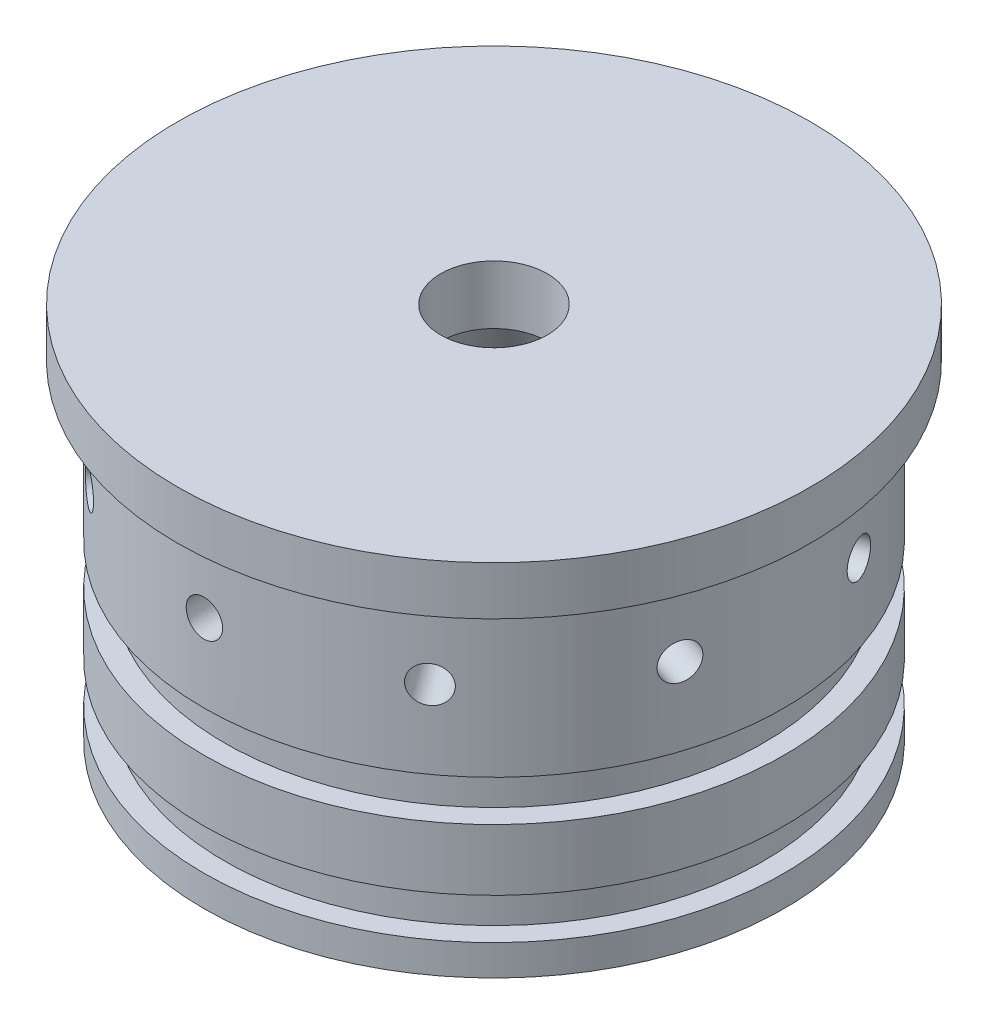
ISO-10303-21;
HEADER;
FILE_DESCRIPTION(('STEP AP214'),'2;1');
FILE_NAME('part.step','',(''),(''),'','','');
FILE_SCHEMA(('AUTOMOTIVE_DESIGN { 1 0 10303 214 1 1 1 1 }'));
ENDSEC;
DATA;
#1=APPLICATION_CONTEXT('core data for automotive mechanical design processes');
#2=APPLICATION_PROTOCOL_DEFINITION('international standard','automotive_design',2000,#1);
#3=PRODUCT_CONTEXT('',#1,'mechanical');
#4=PRODUCT('Part','Part','',(#3));
#5=PRODUCT_RELATED_PRODUCT_CATEGORY('part','',(#4));
#6=PRODUCT_DEFINITION_FORMATION('','',#4);
#7=PRODUCT_DEFINITION_CONTEXT('part definition',#1,'design');
#8=PRODUCT_DEFINITION('design','',#6,#7);
#9=PRODUCT_DEFINITION_SHAPE('','',#8);
#10=(LENGTH_UNIT() NAMED_UNIT(*) SI_UNIT(.MILLI.,.METRE.));
#11=(NAMED_UNIT(*) PLANE_ANGLE_UNIT() SI_UNIT($,.RADIAN.));
#12=(NAMED_UNIT(*) SI_UNIT($,.STERADIAN.) SOLID_ANGLE_UNIT());
#13=UNCERTAINTY_MEASURE_WITH_UNIT(LENGTH_MEASURE(1.E-05),#10,'distance_accuracy_value','');
#14=(GEOMETRIC_REPRESENTATION_CONTEXT(3) GLOBAL_UNCERTAINTY_ASSIGNED_CONTEXT((#13)) GLOBAL_UNIT_ASSIGNED_CONTEXT((#10,
#11,#12)) REPRESENTATION_CONTEXT('',''));
#15=CARTESIAN_POINT('',(0.,0.,0.));
#16=DIRECTION('',(0.,0.,1.));
#17=DIRECTION('',(1.,0.,0.));
#18=AXIS2_PLACEMENT_3D('',#15,#16,#17);
#19=CARTESIAN_POINT('',(0.,0.,0.));
#20=DIRECTION('',(0.,-1.,0.));
#21=DIRECTION('',(0.,0.,-1.));
#22=AXIS2_PLACEMENT_3D('',#19,#20,#21);
#23=CYLINDRICAL_SURFACE('',#22,6.9453125);
#24=CARTESIAN_POINT('',(0.,41.6953891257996,0.));
#25=DIRECTION('',(0.,-1.,0.));
#26=DIRECTION('',(0.,0.,-1.));
#27=AXIS2_PLACEMENT_3D('',#24,#25,#26);
#28=CIRCLE('',#27,6.9453125);
#29=CARTESIAN_POINT('',(0.,41.6953891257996,-6.9453125));
#30=VERTEX_POINT('',#29);
#31=EDGE_CURVE('E211',#30,#30,#28,.T.);
#32=ORIENTED_EDGE('',*,*,#31,.T.);
#33=EDGE_LOOP('',(#32));
#34=FACE_BOUND('',#33,.T.);
#35=CARTESIAN_POINT('',(0.,49.338,0.));
#36=DIRECTION('',(0.,-1.,0.));
#37=DIRECTION('',(0.,0.,-1.));
#38=AXIS2_PLACEMENT_3D('',#35,#36,#37);
#39=CIRCLE('',#38,6.9453125);
#40=CARTESIAN_POINT('',(0.,49.338,-6.9453125));
#41=VERTEX_POINT('',#40);
#42=EDGE_CURVE('E214',#41,#41,#39,.T.);
#43=ORIENTED_EDGE('',*,*,#42,.F.);
#44=EDGE_LOOP('',(#43));
#45=FACE_BOUND('',#44,.T.);
#46=ADVANCED_FACE('F45',(#34,#45),#23,.F.);
#47=CARTESIAN_POINT('',(0.,41.6953891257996,0.));
#48=DIRECTION('',(0.,-1.,0.));
#49=DIRECTION('',(0.,0.,-1.));
#50=AXIS2_PLACEMENT_3D('',#47,#48,#49);
#51=CONICAL_SURFACE('',#50,6.9453125,0.433990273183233);
#52=CARTESIAN_POINT('',(0.,12.7,0.));
#53=DIRECTION('',(0.,-1.,0.));
#54=DIRECTION('',(0.,0.,-1.));
#55=AXIS2_PLACEMENT_3D('',#52,#53,#54);
#56=CIRCLE('',#55,20.3835);
#57=CARTESIAN_POINT('',(0.,12.7,-20.3835));
#58=VERTEX_POINT('',#57);
#59=EDGE_CURVE('E281',#58,#58,#56,.T.);
#60=ORIENTED_EDGE('',*,*,#59,.T.);
#61=EDGE_LOOP('',(#60));
#62=FACE_BOUND('',#61,.T.);
#63=ORIENTED_EDGE('',*,*,#31,.F.);
#64=EDGE_LOOP('',(#63));
#65=FACE_BOUND('',#64,.T.);
#66=ADVANCED_FACE('F201',(#62,#65),#51,.F.);
#67=CARTESIAN_POINT('',(0.,12.7,0.));
#68=DIRECTION('',(0.,1.,0.));
#69=DIRECTION('',(0.,0.,1.));
#70=AXIS2_PLACEMENT_3D('',#67,#68,#69);
#71=PLANE('',#70);
#72=ORIENTED_EDGE('',*,*,#59,.F.);
#73=EDGE_LOOP('',(#72));
#74=FACE_BOUND('',#73,.T.);
#75=CARTESIAN_POINT('',(0.,12.7,0.));
#76=DIRECTION('',(0.,-1.,0.));
#77=DIRECTION('',(0.,0.,-1.));
#78=AXIS2_PLACEMENT_3D('',#75,#76,#77);
#79=CIRCLE('',#78,26.7335);
#80=CARTESIAN_POINT('',(0.,12.7,-26.7335));
#81=VERTEX_POINT('',#80);
#82=EDGE_CURVE('E277',#81,#81,#79,.T.);
#83=ORIENTED_EDGE('',*,*,#82,.T.);
#84=EDGE_LOOP('',(#83));
#85=FACE_BOUND('',#84,.T.);
#86=ADVANCED_FACE('F206',(#74,#85),#71,.F.);
#87=CARTESIAN_POINT('',(0.,0.,0.));
#88=DIRECTION('',(0.,-1.,0.));
#89=DIRECTION('',(0.,0.,-1.));
#90=AXIS2_PLACEMENT_3D('',#87,#88,#89);
#91=CYLINDRICAL_SURFACE('',#90,26.7335);
#92=ORIENTED_EDGE('',*,*,#82,.F.);
#93=EDGE_LOOP('',(#92));
#94=FACE_BOUND('',#93,.T.);
#95=CARTESIAN_POINT('',(0.,0.,0.));
#96=DIRECTION('',(0.,-1.,0.));
#97=DIRECTION('',(0.,0.,-1.));
#98=AXIS2_PLACEMENT_3D('',#95,#96,#97);
#99=CIRCLE('',#98,26.7335);
#100=CARTESIAN_POINT('',(0.,0.,-26.7335));
#101=VERTEX_POINT('',#100);
#102=EDGE_CURVE('E273',#101,#101,#99,.T.);
#103=ORIENTED_EDGE('',*,*,#102,.T.);
#104=EDGE_LOOP('',(#103));
#105=FACE_BOUND('',#104,.T.);
#106=ADVANCED_FACE('F350',(#94,#105),#91,.F.);
#107=CARTESIAN_POINT('',(0.,0.,0.));
#108=DIRECTION('',(0.,-1.,0.));
#109=DIRECTION('',(0.,0.,-1.));
#110=AXIS2_PLACEMENT_3D('',#107,#108,#109);
#111=PLANE('',#110);
#112=CARTESIAN_POINT('',(0.,0.,0.));
#113=DIRECTION('',(0.,-1.,0.));
#114=DIRECTION('',(0.,0.,-1.));
#115=AXIS2_PLACEMENT_3D('',#112,#113,#114);
#116=CIRCLE('',#115,37.846);
#117=CARTESIAN_POINT('',(0.,0.,-37.846));
#118=VERTEX_POINT('',#117);
#119=EDGE_CURVE('E269',#118,#118,#116,.T.);
#120=ORIENTED_EDGE('',*,*,#119,.T.);
#121=EDGE_LOOP('',(#120));
#122=FACE_BOUND('',#121,.T.);
#123=ORIENTED_EDGE('',*,*,#102,.F.);
#124=EDGE_LOOP('',(#123));
#125=FACE_BOUND('',#124,.T.);
#126=ADVANCED_FACE('F344',(#122,#125),#111,.T.);
#127=CARTESIAN_POINT('',(0.,0.,0.));
#128=DIRECTION('',(0.,-1.,0.));
#129=DIRECTION('',(0.,0.,-1.));
#130=AXIS2_PLACEMENT_3D('',#127,#128,#129);
#131=CYLINDRICAL_SURFACE('',#130,37.846);
#132=CARTESIAN_POINT('',(0.,4.,0.));
#133=DIRECTION('',(0.,-1.,0.));
#134=DIRECTION('',(0.,0.,-1.));
#135=AXIS2_PLACEMENT_3D('',#132,#133,#134);
#136=CIRCLE('',#135,37.846);
#137=CARTESIAN_POINT('',(0.,4.,-37.846));
#138=VERTEX_POINT('',#137);
#139=EDGE_CURVE('E265',#138,#138,#136,.T.);
#140=ORIENTED_EDGE('',*,*,#139,.T.);
#141=EDGE_LOOP('',(#140));
#142=FACE_BOUND('',#141,.T.);
#143=ORIENTED_EDGE('',*,*,#119,.F.);
#144=EDGE_LOOP('',(#143));
#145=FACE_BOUND('',#144,.T.);
#146=ADVANCED_FACE('F338',(#142,#145),#131,.T.);
#147=CARTESIAN_POINT('',(0.,4.,0.));
#148=DIRECTION('',(0.,1.,0.));
#149=DIRECTION('',(0.,0.,1.));
#150=AXIS2_PLACEMENT_3D('',#147,#148,#149);
#151=PLANE('',#150);
#152=CARTESIAN_POINT('',(0.,4.,0.));
#153=DIRECTION('',(0.,-1.,0.));
#154=DIRECTION('',(0.,0.,-1.));
#155=AXIS2_PLACEMENT_3D('',#152,#153,#154);
#156=CIRCLE('',#155,35.1282);
#157=CARTESIAN_POINT('',(0.,4.,-35.1282));
#158=VERTEX_POINT('',#157);
#159=EDGE_CURVE('E261',#158,#158,#156,.T.);
#160=ORIENTED_EDGE('',*,*,#159,.T.);
#161=EDGE_LOOP('',(#160));
#162=FACE_BOUND('',#161,.T.);
#163=ORIENTED_EDGE('',*,*,#139,.F.);
#164=EDGE_LOOP('',(#163));
#165=FACE_BOUND('',#164,.T.);
#166=ADVANCED_FACE('F332',(#162,#165),#151,.T.);
#167=CARTESIAN_POINT('',(0.,0.,0.));
#168=DIRECTION('',(0.,-1.,0.));
#169=DIRECTION('',(0.,0.,-1.));
#170=AXIS2_PLACEMENT_3D('',#167,#168,#169);
#171=CYLINDRICAL_SURFACE('',#170,35.1282);
#172=CARTESIAN_POINT('',(0.,9.334,0.));
#173=DIRECTION('',(0.,-1.,0.));
#174=DIRECTION('',(0.,0.,-1.));
#175=AXIS2_PLACEMENT_3D('',#172,#173,#174);
#176=CIRCLE('',#175,35.1282);
#177=CARTESIAN_POINT('',(0.,9.334,-35.1282));
#178=VERTEX_POINT('',#177);
#179=EDGE_CURVE('E257',#178,#178,#176,.T.);
#180=ORIENTED_EDGE('',*,*,#179,.T.);
#181=EDGE_LOOP('',(#180));
#182=FACE_BOUND('',#181,.T.);
#183=ORIENTED_EDGE('',*,*,#159,.F.);
#184=EDGE_LOOP('',(#183));
#185=FACE_BOUND('',#184,.T.);
#186=ADVANCED_FACE('F326',(#182,#185),#171,.T.);
#187=CARTESIAN_POINT('',(0.,9.334,0.));
#188=DIRECTION('',(0.,-1.,0.));
#189=DIRECTION('',(0.,0.,-1.));
#190=AXIS2_PLACEMENT_3D('',#187,#188,#189);
#191=PLANE('',#190);
#192=CARTESIAN_POINT('',(0.,9.334,0.));
#193=DIRECTION('',(0.,-1.,0.));
#194=DIRECTION('',(0.,0.,-1.));
#195=AXIS2_PLACEMENT_3D('',#192,#193,#194);
#196=CIRCLE('',#195,37.846);
#197=CARTESIAN_POINT('',(0.,9.334,-37.846));
#198=VERTEX_POINT('',#197);
#199=EDGE_CURVE('E253',#198,#198,#196,.T.);
#200=ORIENTED_EDGE('',*,*,#199,.T.);
#201=EDGE_LOOP('',(#200));
#202=FACE_BOUND('',#201,.T.);
#203=ORIENTED_EDGE('',*,*,#179,.F.);
#204=EDGE_LOOP('',(#203));
#205=FACE_BOUND('',#204,.T.);
#206=ADVANCED_FACE('F320',(#202,#205),#191,.T.);
#207=CARTESIAN_POINT('',(0.,0.,0.));
#208=DIRECTION('',(0.,-1.,0.));
#209=DIRECTION('',(0.,0.,-1.));
#210=AXIS2_PLACEMENT_3D('',#207,#208,#209);
#211=CYLINDRICAL_SURFACE('',#210,37.846);
#212=CARTESIAN_POINT('',(0.,17.334,0.));
#213=DIRECTION('',(0.,-1.,0.));
#214=DIRECTION('',(0.,0.,-1.));
#215=AXIS2_PLACEMENT_3D('',#212,#213,#214);
#216=CIRCLE('',#215,37.846);
#217=CARTESIAN_POINT('',(0.,17.334,-37.846));
#218=VERTEX_POINT('',#217);
#219=EDGE_CURVE('E249',#218,#218,#216,.T.);
#220=ORIENTED_EDGE('',*,*,#219,.T.);
#221=EDGE_LOOP('',(#220));
#222=FACE_BOUND('',#221,.T.);
#223=ORIENTED_EDGE('',*,*,#199,.F.);
#224=EDGE_LOOP('',(#223));
#225=FACE_BOUND('',#224,.T.);
#226=ADVANCED_FACE('F314',(#222,#225),#211,.T.);
#227=CARTESIAN_POINT('',(0.,17.334,0.));
#228=DIRECTION('',(0.,1.,0.));
#229=DIRECTION('',(0.,0.,1.));
#230=AXIS2_PLACEMENT_3D('',#227,#228,#229);
#231=PLANE('',#230);
#232=CARTESIAN_POINT('',(0.,17.334,0.));
#233=DIRECTION('',(0.,-1.,0.));
#234=DIRECTION('',(0.,0.,-1.));
#235=AXIS2_PLACEMENT_3D('',#232,#233,#234);
#236=CIRCLE('',#235,35.1282);
#237=CARTESIAN_POINT('',(0.,17.334,-35.1282));
#238=VERTEX_POINT('',#237);
#239=EDGE_CURVE('E245',#238,#238,#236,.T.);
#240=ORIENTED_EDGE('',*,*,#239,.T.);
#241=EDGE_LOOP('',(#240));
#242=FACE_BOUND('',#241,.T.);
#243=ORIENTED_EDGE('',*,*,#219,.F.);
#244=EDGE_LOOP('',(#243));
#245=FACE_BOUND('',#244,.T.);
#246=ADVANCED_FACE('F308',(#242,#245),#231,.T.);
#247=CARTESIAN_POINT('',(0.,0.,0.));
#248=DIRECTION('',(0.,-1.,0.));
#249=DIRECTION('',(0.,0.,-1.));
#250=AXIS2_PLACEMENT_3D('',#247,#248,#249);
#251=CYLINDRICAL_SURFACE('',#250,35.1282);
#252=CARTESIAN_POINT('',(0.,22.668,0.));
#253=DIRECTION('',(0.,-1.,0.));
#254=DIRECTION('',(0.,0.,-1.));
#255=AXIS2_PLACEMENT_3D('',#252,#253,#254);
#256=CIRCLE('',#255,35.1282);
#257=CARTESIAN_POINT('',(0.,22.668,-35.1282));
#258=VERTEX_POINT('',#257);
#259=EDGE_CURVE('E241',#258,#258,#256,.T.);
#260=ORIENTED_EDGE('',*,*,#259,.T.);
#261=EDGE_LOOP('',(#260));
#262=FACE_BOUND('',#261,.T.);
#263=ORIENTED_EDGE('',*,*,#239,.F.);
#264=EDGE_LOOP('',(#263));
#265=FACE_BOUND('',#264,.T.);
#266=ADVANCED_FACE('F303',(#262,#265),#251,.T.);
#267=CARTESIAN_POINT('',(0.,22.668,0.));
#268=DIRECTION('',(0.,-1.,0.));
#269=DIRECTION('',(0.,0.,-1.));
#270=AXIS2_PLACEMENT_3D('',#267,#268,#269);
#271=PLANE('',#270);
#272=CARTESIAN_POINT('',(0.,22.668,0.));
#273=DIRECTION('',(0.,-1.,0.));
#274=DIRECTION('',(0.,0.,-1.));
#275=AXIS2_PLACEMENT_3D('',#272,#273,#274);
#276=CIRCLE('',#275,37.846);
#277=CARTESIAN_POINT('',(0.,22.668,-37.846));
#278=VERTEX_POINT('',#277);
#279=EDGE_CURVE('E237',#278,#278,#276,.T.);
#280=ORIENTED_EDGE('',*,*,#279,.T.);
#281=EDGE_LOOP('',(#280));
#282=FACE_BOUND('',#281,.T.);
#283=ORIENTED_EDGE('',*,*,#259,.F.);
#284=EDGE_LOOP('',(#283));
#285=FACE_BOUND('',#284,.T.);
#286=ADVANCED_FACE('F295',(#282,#285),#271,.T.);
#287=CARTESIAN_POINT('',(0.,0.,0.));
#288=DIRECTION('',(0.,-1.,0.));
#289=DIRECTION('',(0.,0.,-1.));
#290=AXIS2_PLACEMENT_3D('',#287,#288,#289);
#291=CYLINDRICAL_SURFACE('',#290,37.846);
#292=CARTESIAN_POINT('',(24.1228134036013,32.828,29.1617830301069));
#293=CARTESIAN_POINT('',(24.1228092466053,32.9612581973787,29.1617872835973));
#294=CARTESIAN_POINT('',(24.1141280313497,33.0946096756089,29.1689743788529));
#295=CARTESIAN_POINT('',(24.0795871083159,33.3576303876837,29.197494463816));
#296=CARTESIAN_POINT('',(24.0537074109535,33.4872951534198,29.2188439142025));
#297=CARTESIAN_POINT('',(23.9854130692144,33.739094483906,29.2749315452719));
#298=CARTESIAN_POINT('',(23.9430071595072,33.8612329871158,29.3096626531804));
#299=CARTESIAN_POINT('',(23.8427212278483,34.0945591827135,29.3913000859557));
#300=CARTESIAN_POINT('',(23.7848447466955,34.2057493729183,29.438203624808));
#301=CARTESIAN_POINT('',(23.6549700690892,34.4142229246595,29.5426647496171));
#302=CARTESIAN_POINT('',(23.5829531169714,34.511487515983,29.6002364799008));
#303=CARTESIAN_POINT('',(23.4266683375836,34.6891882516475,29.7240785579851));
#304=CARTESIAN_POINT('',(23.3423999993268,34.7696236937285,29.7903492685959));
#305=CARTESIAN_POINT('',(23.1637190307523,34.911440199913,29.9294946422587));
#306=CARTESIAN_POINT('',(23.0692982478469,34.9728057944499,30.0023746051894));
#307=CARTESIAN_POINT('',(22.8728736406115,35.074641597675,30.1523900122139));
#308=CARTESIAN_POINT('',(22.7708698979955,35.1151120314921,30.2295254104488));
#309=CARTESIAN_POINT('',(22.5621977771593,35.1739567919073,30.3855868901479));
#310=CARTESIAN_POINT('',(22.4555357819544,35.1923604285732,30.4645104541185));
#311=CARTESIAN_POINT('',(22.2403991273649,35.2066396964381,30.6219222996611));
#312=CARTESIAN_POINT('',(22.1319244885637,35.2025155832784,30.7004105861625));
#313=CARTESIAN_POINT('',(21.9164161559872,35.1718805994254,30.8546261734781));
#314=CARTESIAN_POINT('',(21.8093806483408,35.1454012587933,30.9303572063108));
#315=CARTESIAN_POINT('',(21.5997091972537,35.0708564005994,31.0771405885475));
#316=CARTESIAN_POINT('',(21.4970732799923,35.0227907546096,31.1481929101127));
#317=CARTESIAN_POINT('',(21.2991714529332,34.9064019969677,31.2838525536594));
#318=CARTESIAN_POINT('',(21.2039108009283,34.8380645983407,31.3484552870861));
#319=CARTESIAN_POINT('',(21.0237094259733,34.6830825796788,31.4695911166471));
#320=CARTESIAN_POINT('',(20.938768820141,34.5964377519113,31.5261241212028));
#321=CARTESIAN_POINT('',(20.7816720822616,34.4071223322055,31.6299023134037));
#322=CARTESIAN_POINT('',(20.7095382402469,34.3044243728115,31.6771313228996));
#323=CARTESIAN_POINT('',(20.5804864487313,34.0860137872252,31.7611278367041));
#324=CARTESIAN_POINT('',(20.523568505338,33.9703011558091,31.7978953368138));
#325=CARTESIAN_POINT('',(20.4267501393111,33.7291283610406,31.8601777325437));
#326=CARTESIAN_POINT('',(20.3868506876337,33.6036676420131,31.8856919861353));
#327=CARTESIAN_POINT('',(20.3253577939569,33.3465680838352,31.9249258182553));
#328=CARTESIAN_POINT('',(20.3037641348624,33.2149293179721,31.9386455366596));
#329=CARTESIAN_POINT('',(20.2796041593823,32.9494506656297,31.9539916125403));
#330=CARTESIAN_POINT('',(20.2770054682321,32.8156149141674,31.9556385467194));
#331=CARTESIAN_POINT('',(20.2908342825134,32.5493302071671,31.9468593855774));
#332=CARTESIAN_POINT('',(20.3072616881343,32.4168812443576,31.9364333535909));
#333=CARTESIAN_POINT('',(20.3585888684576,32.1572381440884,31.9037378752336));
#334=CARTESIAN_POINT('',(20.3934737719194,32.0300398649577,31.8814779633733));
#335=CARTESIAN_POINT('',(20.4805870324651,31.7843809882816,31.8255861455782));
#336=CARTESIAN_POINT('',(20.5328155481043,31.6659204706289,31.7919541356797));
#337=CARTESIAN_POINT('',(20.6530430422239,31.4409239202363,31.7139819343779));
#338=CARTESIAN_POINT('',(20.7210632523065,31.3344042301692,31.6696273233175));
#339=CARTESIAN_POINT('',(20.8707083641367,31.1364776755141,31.5712091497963));
#340=CARTESIAN_POINT('',(20.9523334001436,31.0450709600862,31.5171454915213));
#341=CARTESIAN_POINT('',(21.1267984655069,30.8798357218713,31.4004635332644));
#342=CARTESIAN_POINT('',(21.2196540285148,30.8060319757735,31.3378333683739));
#343=CARTESIAN_POINT('',(21.4136671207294,30.6782672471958,31.2055818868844));
#344=CARTESIAN_POINT('',(21.5148245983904,30.6243061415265,31.1359606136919));
#345=CARTESIAN_POINT('',(21.7223397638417,30.5378015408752,30.9915412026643));
#346=CARTESIAN_POINT('',(21.828693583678,30.5052423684,30.9167468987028));
#347=CARTESIAN_POINT('',(22.0435456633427,30.462414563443,30.7639266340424));
#348=CARTESIAN_POINT('',(22.1520439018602,30.4521457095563,30.6859007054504));
#349=CARTESIAN_POINT('',(22.3678743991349,30.4541921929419,30.5289319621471));
#350=CARTESIAN_POINT('',(22.4752083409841,30.4664687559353,30.4499909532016));
#351=CARTESIAN_POINT('',(22.6858901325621,30.5131771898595,30.2933547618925));
#352=CARTESIAN_POINT('',(22.7892379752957,30.5476090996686,30.2156595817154));
#353=CARTESIAN_POINT('',(22.9891228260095,30.6376420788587,30.0638605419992));
#354=CARTESIAN_POINT('',(23.0856598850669,30.6932429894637,29.9897566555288));
#355=CARTESIAN_POINT('',(23.2693551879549,30.8240302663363,29.8474511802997));
#356=CARTESIAN_POINT('',(23.3565136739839,30.8992161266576,29.7792494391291));
#357=CARTESIAN_POINT('',(23.5193271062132,31.0671822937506,29.6508306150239));
#358=CARTESIAN_POINT('',(23.5949633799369,31.1599906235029,29.5906265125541));
#359=CARTESIAN_POINT('',(23.7326557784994,31.3605297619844,29.4803082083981));
#360=CARTESIAN_POINT('',(23.7947085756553,31.468264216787,29.4301964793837));
#361=CARTESIAN_POINT('',(23.90372020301,31.6957214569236,29.3417250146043));
#362=CARTESIAN_POINT('',(23.9506601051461,31.8154590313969,29.3033800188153));
#363=CARTESIAN_POINT('',(24.028128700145,32.06332935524,29.2398919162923));
#364=CARTESIAN_POINT('',(24.0586766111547,32.1914520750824,29.2147333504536));
#365=CARTESIAN_POINT('',(24.0946786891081,32.4049652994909,29.1850386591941));
#366=CARTESIAN_POINT('',(24.1052171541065,32.4889757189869,29.176331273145));
#367=CARTESIAN_POINT('',(24.119285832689,32.6579781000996,29.1647021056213));
#368=CARTESIAN_POINT('',(24.1228160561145,32.7429700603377,29.1617803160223));
#369=CARTESIAN_POINT('',(24.1228134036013,32.828,29.1617830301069));
#370=B_SPLINE_CURVE_WITH_KNOTS('',3,(#292,#293,#294,#295,#296,#297,#298,#299,#300,#301,#302,
#303,#304,#305,#306,#307,#308,#309,#310,#311,#312,#313,#314,#315,#316,#317,#318,#319,#320,#321,
#322,#323,#324,#325,#326,#327,#328,#329,#330,#331,#332,#333,#334,#335,#336,#337,#338,#339,#340,
#341,#342,#343,#344,#345,#346,#347,#348,#349,#350,#351,#352,#353,#354,#355,#356,#357,#358,#359,
#360,#361,#362,#363,#364,#365,#366,#367,#368,#369),.UNSPECIFIED.,.T.,.F.,(4,2,2,2,2,2,2,2,2,2,2,
2,2,2,2,2,2,2,2,2,2,2,2,2,2,2,2,2,2,2,2,2,2,2,2,2,2,2,4),(0.,0.399464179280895,
0.799393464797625,1.19911166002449,1.59873844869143,1.99889892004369,2.39907608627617,
2.79957703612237,3.20007367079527,3.60003775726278,3.99999730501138,4.39939368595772,
4.79879244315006,5.19847335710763,5.59815880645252,5.99853322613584,6.39890780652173,
6.79930522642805,7.19969789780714,7.59940798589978,7.99911597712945,8.39850241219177,
8.79789249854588,9.19782269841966,9.59775684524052,9.99825063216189,10.3987419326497,
10.7989395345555,11.1991331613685,11.5986391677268,11.9981458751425,12.3976495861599,
12.7971429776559,13.1972770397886,13.5975090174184,13.9982403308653,14.3985007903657,
14.6533928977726,14.9082846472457),.UNSPECIFIED.);
#371=CARTESIAN_POINT('',(24.1228134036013,32.828,29.1617830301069));
#372=VERTEX_POINT('',#371);
#373=EDGE_CURVE('E10',#372,#372,#370,.T.);
#374=ORIENTED_EDGE('',*,*,#373,.F.);
#375=EDGE_LOOP('',(#374));
#376=FACE_BOUND('',#375,.T.);
#377=CARTESIAN_POINT('',(36.656631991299,32.828,9.41334409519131));
#378=CARTESIAN_POINT('',(36.6566311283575,32.9612581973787,9.41334997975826));
#379=CARTESIAN_POINT('',(36.653832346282,33.0946096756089,9.42426715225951));
#380=CARTESIAN_POINT('',(36.6426518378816,33.3576303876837,9.46764303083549));
#381=CARTESIAN_POINT('',(36.6342636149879,33.4872951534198,9.50012680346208));
#382=CARTESIAN_POINT('',(36.61197981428,33.739094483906,9.58564505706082));
#383=CARTESIAN_POINT('',(36.5980871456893,33.8612329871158,9.63866868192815));
#384=CARTESIAN_POINT('',(36.5649394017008,34.0945591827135,9.76366134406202));
#385=CARTESIAN_POINT('',(36.5456855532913,34.2057493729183,9.8356260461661));
#386=CARTESIAN_POINT('',(36.5020154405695,34.4142229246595,9.99647529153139));
#387=CARTESIAN_POINT('',(36.4775923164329,34.511487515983,10.0853823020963));
#388=CARTESIAN_POINT('',(36.4239478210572,34.6891882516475,10.2774345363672));
#389=CARTESIAN_POINT('',(36.3947262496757,34.7696236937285,10.3805803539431));
#390=CARTESIAN_POINT('',(36.3319579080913,34.911440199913,10.5981773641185));
#391=CARTESIAN_POINT('',(36.2984076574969,34.9728057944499,10.7126376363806));
#392=CARTESIAN_POINT('',(36.2276736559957,35.074641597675,10.9494581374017));
#393=CARTESIAN_POINT('',(36.1904899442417,35.1151120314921,11.0718182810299));
#394=CARTESIAN_POINT('',(36.113401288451,35.1739567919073,11.320729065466));
#395=CARTESIAN_POINT('',(36.0735000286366,35.1923604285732,11.4472739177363));
#396=CARTESIAN_POINT('',(35.9919751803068,35.2066396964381,11.7010769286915));
#397=CARTESIAN_POINT('',(35.9503516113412,35.2025155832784,11.8283350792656));
#398=CARTESIAN_POINT('',(35.8666473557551,35.1718805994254,12.079770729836));
#399=CARTESIAN_POINT('',(35.8245673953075,35.1454012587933,12.2039523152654));
#400=CARTESIAN_POINT('',(35.7412167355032,35.0708564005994,12.4459443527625));
#401=CARTESIAN_POINT('',(35.6999460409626,35.0227907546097,12.5637547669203));
#402=CARTESIAN_POINT('',(35.6195788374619,34.9064019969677,12.7898294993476));
#403=CARTESIAN_POINT('',(35.5804838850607,34.8380645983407,12.898087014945));
#404=CARTESIAN_POINT('',(35.5058997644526,34.6830825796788,13.102007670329));
#405=CARTESIAN_POINT('',(35.4704106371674,34.5964377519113,13.1976706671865));
#406=CARTESIAN_POINT('',(35.4043159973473,34.4071223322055,13.3739681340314));
#407=CARTESIAN_POINT('',(35.3737190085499,34.3044243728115,13.4545764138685));
#408=CARTESIAN_POINT('',(35.3186858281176,34.0860137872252,13.5983857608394));
#409=CARTESIAN_POINT('',(35.2942496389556,33.9703011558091,13.6615868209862));
#410=CARTESIAN_POINT('',(35.2525306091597,33.7291283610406,13.7688827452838));
#411=CARTESIAN_POINT('',(35.2352481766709,33.6036676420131,13.8129765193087));
#412=CARTESIAN_POINT('',(35.2085604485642,33.3465680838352,13.8808619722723));
#413=CARTESIAN_POINT('',(35.1991550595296,33.2149293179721,13.9046538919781));
#414=CARTESIAN_POINT('',(35.1886294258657,32.9494506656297,13.9312700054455));
#415=CARTESIAN_POINT('',(35.1874950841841,32.8156149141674,13.9341298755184));
#416=CARTESIAN_POINT('',(35.1935225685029,32.5493302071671,13.918899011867));
#417=CARTESIAN_POINT('',(35.2006843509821,32.4168812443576,13.9008083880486));
#418=CARTESIAN_POINT('',(35.222990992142,32.1572381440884,13.8441878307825));
#419=CARTESIAN_POINT('',(35.2381294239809,32.0300398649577,13.8056743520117));
#420=CARTESIAN_POINT('',(35.275753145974,31.7843809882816,13.7092530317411));
#421=CARTESIAN_POINT('',(35.2982385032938,31.6659204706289,13.6513450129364));
#422=CARTESIAN_POINT('',(35.3496736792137,31.4409239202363,13.5175962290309));
#423=CARTESIAN_POINT('',(35.3786321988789,31.3344042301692,13.4417313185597));
#424=CARTESIAN_POINT('',(35.4418488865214,31.1364776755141,13.2741501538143));
#425=CARTESIAN_POINT('',(35.4761071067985,31.0450709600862,13.182433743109));
#426=CARTESIAN_POINT('',(35.5486683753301,30.8798357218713,12.9854880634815));
#427=CARTESIAN_POINT('',(35.5869770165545,30.8060319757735,12.8802400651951));
#428=CARTESIAN_POINT('',(35.6662014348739,30.6782672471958,12.6592083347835));
#429=CARTESIAN_POINT('',(35.7071171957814,30.6243061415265,12.5434246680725));
#430=CARTESIAN_POINT('',(35.7901128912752,30.5378015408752,12.3046125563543));
#431=CARTESIAN_POINT('',(35.8321919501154,30.5052423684,12.1815894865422));
#432=CARTESIAN_POINT('',(35.9161854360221,30.462414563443,11.9316684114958));
#433=CARTESIAN_POINT('',(35.9580998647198,30.4521457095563,11.8047704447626));
#434=CARTESIAN_POINT('',(36.0404464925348,30.4541921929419,11.5509180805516));
#435=CARTESIAN_POINT('',(36.0808811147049,30.4664687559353,11.4239641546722));
#436=CARTESIAN_POINT('',(36.1592578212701,30.5131771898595,11.1734071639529));
#437=CARTESIAN_POINT('',(36.1971999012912,30.5476090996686,11.0498041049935));
#438=CARTESIAN_POINT('',(36.2696849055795,30.6376420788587,10.8095067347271));
#439=CARTESIAN_POINT('',(36.304227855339,30.6932429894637,10.6928123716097));
#440=CARTESIAN_POINT('',(36.3691954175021,30.8240302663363,10.4697114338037));
#441=CARTESIAN_POINT('',(36.3996201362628,30.8992161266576,10.3633045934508));
#442=CARTESIAN_POINT('',(36.4558562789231,31.0671822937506,10.1637122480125));
#443=CARTESIAN_POINT('',(36.4816602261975,31.1599906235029,10.0705482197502));
#444=CARTESIAN_POINT('',(36.52821224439,31.3605297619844,9.90036527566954));
#445=CARTESIAN_POINT('',(36.5489590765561,31.468264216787,9.82335031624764));
#446=CARTESIAN_POINT('',(36.5851491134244,31.6957214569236,9.68769997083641));
#447=CARTESIAN_POINT('',(36.6005856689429,31.8154590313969,9.62908763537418));
#448=CARTESIAN_POINT('',(36.6259417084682,32.06332935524,9.53218978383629));
#449=CARTESIAN_POINT('',(36.635867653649,32.1914520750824,9.4938804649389));
#450=CARTESIAN_POINT('',(36.6475398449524,32.4049652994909,9.44869546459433));
#451=CARTESIAN_POINT('',(36.650947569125,32.4889757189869,9.43545668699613));
#452=CARTESIAN_POINT('',(36.6554939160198,32.6579781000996,9.41777913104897));
#453=CARTESIAN_POINT('',(36.6566325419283,32.7429700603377,9.41334034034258));
#454=CARTESIAN_POINT('',(36.656631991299,32.828,9.41334409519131));
#455=B_SPLINE_CURVE_WITH_KNOTS('',3,(#377,#378,#379,#380,#381,#382,#383,#384,#385,#386,#387,
#388,#389,#390,#391,#392,#393,#394,#395,#396,#397,#398,#399,#400,#401,#402,#403,#404,#405,#406,
#407,#408,#409,#410,#411,#412,#413,#414,#415,#416,#417,#418,#419,#420,#421,#422,#423,#424,#425,
#426,#427,#428,#429,#430,#431,#432,#433,#434,#435,#436,#437,#438,#439,#440,#441,#442,#443,#444,
#445,#446,#447,#448,#449,#450,#451,#452,#453,#454),.UNSPECIFIED.,.T.,.F.,(4,2,2,2,2,2,2,2,2,2,2,
2,2,2,2,2,2,2,2,2,2,2,2,2,2,2,2,2,2,2,2,2,2,2,2,2,2,2,4),(0.,0.399464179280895,
0.799393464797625,1.19911166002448,1.59873844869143,1.99889892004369,2.39907608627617,
2.79957703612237,3.20007367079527,3.60003775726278,3.99999730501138,4.39939368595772,
4.79879244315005,5.19847335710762,5.59815880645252,5.99853322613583,6.39890780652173,
6.79930522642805,7.19969789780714,7.59940798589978,7.99911597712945,8.39850241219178,
8.79789249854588,9.19782269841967,9.59775684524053,9.9982506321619,10.3987419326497,
10.7989395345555,11.1991331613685,11.5986391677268,11.9981458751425,12.3976495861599,
12.7971429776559,13.1972770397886,13.5975090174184,13.9982403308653,14.3985007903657,
14.6533928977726,14.9082846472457),.UNSPECIFIED.);
#456=CARTESIAN_POINT('',(36.656631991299,32.828,9.41334409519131));
#457=VERTEX_POINT('',#456);
#458=EDGE_CURVE('E57',#457,#457,#455,.T.);
#459=ORIENTED_EDGE('',*,*,#458,.F.);
#460=EDGE_LOOP('',(#459));
#461=FACE_BOUND('',#460,.T.);
#462=CARTESIAN_POINT('',(35.1888630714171,32.828,-13.9306723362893));
#463=CARTESIAN_POINT('',(35.1888658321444,32.9612581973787,-13.9306670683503));
#464=CARTESIAN_POINT('',(35.1930185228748,33.0946096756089,-13.9201898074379));
#465=CARTESIAN_POINT('',(35.2094690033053,33.3576303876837,-13.8785262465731));
#466=CARTESIAN_POINT('',(35.2217762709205,33.4872951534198,-13.8473158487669));
#467=CARTESIAN_POINT('',(35.2540146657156,33.739094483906,-13.7650320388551));
#468=CARTESIAN_POINT('',(35.2739417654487,33.8612329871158,-13.7139691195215));
#469=CARTESIAN_POINT('',(35.3205935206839,34.0945591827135,-13.5933641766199));
#470=CARTESIAN_POINT('',(35.3473166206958,34.2057493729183,-13.5238263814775));
#471=CARTESIAN_POINT('',(35.4065315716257,34.4142229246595,-13.3680279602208));
#472=CARTESIAN_POINT('',(35.4390310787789,34.511487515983,-13.2817451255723));
#473=CARTESIAN_POINT('',(35.5085172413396,34.6891882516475,-13.094840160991));
#474=CARTESIAN_POINT('',(35.5455040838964,34.7696236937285,-12.9942174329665));
#475=CARTESIAN_POINT('',(35.6226237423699,34.911440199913,-12.7812834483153));
#476=CARTESIAN_POINT('',(35.6627590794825,34.9728057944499,-12.6689628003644));
#477=CARTESIAN_POINT('',(35.7447336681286,35.074641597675,-12.4357945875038));
#478=CARTESIAN_POINT('',(35.7865729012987,35.1151120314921,-12.31494711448));
#479=CARTESIAN_POINT('',(35.8705129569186,35.1739567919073,-12.0682624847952));
#480=CARTESIAN_POINT('',(35.9126133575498,35.1923604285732,-11.942432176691));
#481=CARTESIAN_POINT('',(35.995840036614,35.2066396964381,-11.6891821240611));
#482=CARTESIAN_POINT('',(36.0369663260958,35.2025155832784,-11.5617623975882));
#483=CARTESIAN_POINT('',(36.117038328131,35.1718805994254,-11.3091465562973));
#484=CARTESIAN_POINT('',(36.155987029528,35.1454012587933,-11.1839475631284));
#485=CARTESIAN_POINT('',(36.2307942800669,35.0708564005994,-10.939179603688));
#486=CARTESIAN_POINT('',(36.2666528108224,35.0227907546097,-10.8196106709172));
#487=CARTESIAN_POINT('',(36.3345177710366,34.9064019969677,-10.5894737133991));
#488=CARTESIAN_POINT('',(36.3665214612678,34.8380645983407,-10.4789121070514));
#489=CARTESIAN_POINT('',(36.4260431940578,34.6830825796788,-10.270097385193));
#490=CARTESIAN_POINT('',(36.4535611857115,34.5964377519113,-10.1718444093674));
#491=CARTESIAN_POINT('',(36.5037145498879,34.4071223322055,-9.99036730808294));
#492=CARTESIAN_POINT('',(36.526341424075,34.3044243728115,-9.90716938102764));
#493=CARTESIAN_POINT('',(36.5663476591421,34.0860137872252,-9.75847748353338));
#494=CARTESIAN_POINT('',(36.5837270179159,33.9703011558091,-9.69298352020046));
#495=CARTESIAN_POINT('',(36.6130425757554,33.7291283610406,-9.58165746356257));
#496=CARTESIAN_POINT('',(36.6249784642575,33.6036676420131,-9.53582649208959));
#497=CARTESIAN_POINT('',(36.6432897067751,33.3465680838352,-9.46521935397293));
#498=CARTESIAN_POINT('',(36.6496651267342,33.2149293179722,-9.44044293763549));
#499=CARTESIAN_POINT('',(36.6567942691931,32.9494506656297,-9.41272323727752));
#500=CARTESIAN_POINT('',(36.6575575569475,32.8156149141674,-9.40974280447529));
#501=CARTESIAN_POINT('',(36.6534814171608,32.5493302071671,-9.42560769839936));
#502=CARTESIAN_POINT('',(36.6486420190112,32.4168812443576,-9.44445291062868));
#503=CARTESIAN_POINT('',(36.6334077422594,32.1572381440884,-9.50337141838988));
#504=CARTESIAN_POINT('',(36.6230173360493,32.0300398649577,-9.5434276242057));
#505=CARTESIAN_POINT('',(36.5967805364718,31.7843809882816,-9.64354877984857));
#506=CARTESIAN_POINT('',(36.5809340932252,31.6659204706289,-9.70361391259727));
#507=CARTESIAN_POINT('',(36.5439304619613,31.4409239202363,-9.84205178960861));
#508=CARTESIAN_POINT('',(36.522766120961,31.3344042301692,-9.92044918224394));
#509=CARTESIAN_POINT('',(36.4754077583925,31.1364776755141,-10.0931830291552));
#510=CARTESIAN_POINT('',(36.4492136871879,31.0450709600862,-10.1875196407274));
#511=CARTESIAN_POINT('',(36.3921552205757,30.8798357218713,-10.3895024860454));
#512=CARTESIAN_POINT('',(36.3612843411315,30.8060319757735,-10.49716715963));
#513=CARTESIAN_POINT('',(36.2954590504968,30.6782672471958,-10.7225525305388));
#514=CARTESIAN_POINT('',(36.2605046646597,30.6243061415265,-10.8402731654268));
#515=CARTESIAN_POINT('',(36.1872793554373,30.5378015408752,-11.0822598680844));
#516=CARTESIAN_POINT('',(36.1490108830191,30.5052423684,-11.2065210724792));
#517=CARTESIAN_POINT('',(36.0700631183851,30.462414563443,-11.4580816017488));
#518=CARTESIAN_POINT('',(36.0293838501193,30.4521457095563,-11.5853808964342));
#519=CARTESIAN_POINT('',(35.9467929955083,30.4541921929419,-11.8391539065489));
#520=CARTESIAN_POINT('',(35.9048836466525,30.4664687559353,-11.9656286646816));
#521=CARTESIAN_POINT('',(35.8210180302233,30.5131771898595,-12.2144022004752));
#522=CARTESIAN_POINT('',(35.7790617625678,30.5476090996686,-12.3367009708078));
#523=CARTESIAN_POINT('',(35.6964601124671,30.6376420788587,-12.5737112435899));
#524=CARTESIAN_POINT('',(35.6558147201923,30.6932429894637,-12.688422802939));
#525=CARTESIAN_POINT('',(35.5772391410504,30.8240302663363,-12.9071022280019));
#526=CARTESIAN_POINT('',(35.5393088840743,30.8992161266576,-13.0110703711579));
#527=CARTESIAN_POINT('',(35.4674874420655,31.0671822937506,-13.2055987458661));
#528=CARTESIAN_POINT('',(35.4336028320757,31.1599906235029,-13.2961372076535));
#529=CARTESIAN_POINT('',(35.3712331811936,31.3605297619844,-13.4611806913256));
#530=CARTESIAN_POINT('',(35.3427494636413,31.468264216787,-13.535681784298));
#531=CARTESIAN_POINT('',(35.2922945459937,31.6957214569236,-13.6666971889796));
#532=CARTESIAN_POINT('',(35.2703315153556,31.8154590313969,-13.7231889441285));
#533=CARTESIAN_POINT('',(35.2338898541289,32.06332935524,-13.8164848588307));
#534=CARTESIAN_POINT('',(35.2194024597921,32.1914520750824,-13.8533120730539));
#535=CARTESIAN_POINT('',(35.2022863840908,32.4049652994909,-13.8967282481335));
#536=CARTESIAN_POINT('',(35.197261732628,32.4889757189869,-13.9094416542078));
#537=CARTESIAN_POINT('',(35.1905491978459,32.6579781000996,-13.9264153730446));
#538=CARTESIAN_POINT('',(35.1888613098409,32.7429700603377,-13.9306756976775));
#539=CARTESIAN_POINT('',(35.1888630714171,32.828,-13.9306723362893));
#540=B_SPLINE_CURVE_WITH_KNOTS('',3,(#462,#463,#464,#465,#466,#467,#468,#469,#470,#471,#472,
#473,#474,#475,#476,#477,#478,#479,#480,#481,#482,#483,#484,#485,#486,#487,#488,#489,#490,#491,
#492,#493,#494,#495,#496,#497,#498,#499,#500,#501,#502,#503,#504,#505,#506,#507,#508,#509,#510,
#511,#512,#513,#514,#515,#516,#517,#518,#519,#520,#521,#522,#523,#524,#525,#526,#527,#528,#529,
#530,#531,#532,#533,#534,#535,#536,#537,#538,#539),.UNSPECIFIED.,.T.,.F.,(4,2,2,2,2,2,2,2,2,2,2,
2,2,2,2,2,2,2,2,2,2,2,2,2,2,2,2,2,2,2,2,2,2,2,2,2,2,2,4),(0.,0.399464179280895,
0.799393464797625,1.19911166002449,1.59873844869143,1.99889892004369,2.39907608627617,
2.79957703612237,3.20007367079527,3.60003775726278,3.99999730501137,4.39939368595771,
4.79879244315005,5.19847335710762,5.59815880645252,5.99853322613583,6.39890780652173,
6.79930522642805,7.19969789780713,7.59940798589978,7.99911597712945,8.39850241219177,
8.79789249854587,9.19782269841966,9.59775684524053,9.99825063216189,10.3987419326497,
10.7989395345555,11.1991331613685,11.5986391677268,11.9981458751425,12.3976495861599,
12.7971429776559,13.1972770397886,13.5975090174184,13.9982403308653,14.3985007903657,
14.6533928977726,14.9082846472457),.UNSPECIFIED.);
#541=CARTESIAN_POINT('',(35.1888630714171,32.828,-13.9306723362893));
#542=VERTEX_POINT('',#541);
#543=EDGE_CURVE('E62',#542,#542,#540,.T.);
#544=ORIENTED_EDGE('',*,*,#543,.F.);
#545=EDGE_LOOP('',(#544));
#546=FACE_BOUND('',#545,.T.);
#547=CARTESIAN_POINT('',(20.2801444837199,32.828,-31.9536454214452));
#548=CARTESIAN_POINT('',(20.280149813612,32.9612581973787,-31.9536427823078));
#549=CARTESIAN_POINT('',(20.289667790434,33.0946096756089,-31.9476073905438));
#550=CARTESIAN_POINT('',(20.3274657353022,33.3576303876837,-31.9235702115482));
#551=CARTESIAN_POINT('',(20.3557675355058,33.4872951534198,-31.9055544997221));
#552=CARTESIAN_POINT('',(20.4302141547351,33.739094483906,-31.8579347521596));
#553=CARTESIAN_POINT('',(20.476349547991,33.8612329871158,-31.8283368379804));
#554=CARTESIAN_POINT('',(20.5849814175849,34.0945591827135,-31.7581866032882));
#555=CARTESIAN_POINT('',(20.6474741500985,34.2057493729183,-31.7176367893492));
#556=CARTESIAN_POINT('',(20.7869560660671,34.4142229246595,-31.6263988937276));
#557=CARTESIAN_POINT('',(20.8639644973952,34.511487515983,-31.5756973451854));
#558=CARTESIAN_POINT('',(21.0300399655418,34.6891882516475,-31.4653309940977));
#559=CARTESIAN_POINT('',(21.1191075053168,34.7696236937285,-31.4056658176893));
#560=CARTESIAN_POINT('',(21.3066580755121,34.911440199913,-31.278728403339));
#561=CARTESIAN_POINT('',(21.4051486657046,34.9728057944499,-31.2114500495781));
#562=CARTESIAN_POINT('',(21.6085203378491,35.074641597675,-31.0709964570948));
#563=CARTESIAN_POINT('',(21.7134013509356,35.1151120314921,-30.9978212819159));
#564=CARTESIAN_POINT('',(21.9263078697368,35.1739567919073,-30.8475879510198));
#565=CARTESIAN_POINT('',(22.0343290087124,35.1923604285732,-30.7705350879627));
#566=CARTESIAN_POINT('',(22.2505174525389,35.2066396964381,-30.61457090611));
#567=CARTESIAN_POINT('',(22.3586847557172,35.2025155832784,-30.5356596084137));
#568=CARTESIAN_POINT('',(22.5719482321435,35.1718805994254,-30.3783542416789));
#569=CARTESIAN_POINT('',(22.6770485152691,35.1454012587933,-30.2999596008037));
#570=CARTESIAN_POINT('',(22.8814398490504,35.0708564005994,-30.1459087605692));
#571=CARTESIAN_POINT('',(22.9807308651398,35.0227907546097,-30.0702525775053));
#572=CARTESIAN_POINT('',(23.1709058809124,34.9064019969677,-29.9239578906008));
#573=CARTESIAN_POINT('',(23.261783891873,34.8380645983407,-29.8533229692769));
#574=CARTESIAN_POINT('',(23.4326761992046,34.6830825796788,-29.7193743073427));
#575=CARTESIAN_POINT('',(23.5126903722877,34.5964377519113,-29.6560606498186));
#576=CARTESIAN_POINT('',(23.6599348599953,34.4071223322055,-29.5387219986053));
#577=CARTESIAN_POINT('',(23.7271429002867,34.3044243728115,-29.4847132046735));
#578=CARTESIAN_POINT('',(23.8469075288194,34.0860137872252,-29.3879340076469));
#579=CARTESIAN_POINT('',(23.89946411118,33.9703011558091,-29.3451636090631));
#580=CARTESIAN_POINT('',(23.9886167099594,33.7291283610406,-29.2723301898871));
#581=CARTESIAN_POINT('',(24.0252118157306,33.6036676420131,-29.2422678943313));
#582=CARTESIAN_POINT('',(24.081527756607,33.3465680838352,-29.1959085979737));
#583=CARTESIAN_POINT('',(24.1012487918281,33.2149293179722,-29.1796114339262));
#584=CARTESIAN_POINT('',(24.123309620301,32.9494506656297,-29.1613761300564));
#585=CARTESIAN_POINT('',(24.1256789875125,32.8156149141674,-29.1594135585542));
#586=CARTESIAN_POINT('',(24.1130561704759,32.5493302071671,-29.1698526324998));
#587=CARTESIAN_POINT('',(24.0980640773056,32.4168812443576,-29.1822542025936));
#588=CARTESIAN_POINT('',(24.0511078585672,32.1572381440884,-29.2209657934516));
#589=CARTESIAN_POINT('',(24.0191573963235,32.0300398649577,-29.2472646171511));
#590=CARTESIAN_POINT('',(23.9390816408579,31.7843809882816,-29.3128427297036));
#591=CARTESIAN_POINT('',(23.8909561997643,31.6659204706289,-29.3521221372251));
#592=CARTESIAN_POINT('',(23.7796478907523,31.4409239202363,-29.4423705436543));
#593=CARTESIAN_POINT('',(23.7164447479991,31.3344042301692,-29.4933552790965));
#594=CARTESIAN_POINT('',(23.5766006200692,31.1364776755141,-29.6052633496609));
#595=CARTESIAN_POINT('',(23.4999595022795,31.0450709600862,-29.6661867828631));
#596=CARTESIAN_POINT('',(23.3350756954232,30.8798357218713,-29.7960562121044));
#597=CARTESIAN_POINT('',(23.2468169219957,30.8060319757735,-29.8650133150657));
#598=CARTESIAN_POINT('',(23.0610849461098,30.6782672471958,-30.0086627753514));
#599=CARTESIAN_POINT('',(22.963611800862,30.6243061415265,-30.0833550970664));
#600=CARTESIAN_POINT('',(22.7621350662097,30.5378015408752,-30.2360856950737));
#601=CARTESIAN_POINT('',(22.6581363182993,30.5052423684,-30.3141214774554));
#602=CARTESIAN_POINT('',(22.4464026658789,30.462414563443,-30.4712338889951));
#603=CARTESIAN_POINT('',(22.3386677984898,30.4521457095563,-30.5503105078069));
#604=CARTESIAN_POINT('',(22.1226863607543,30.4541921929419,-30.7070714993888));
#605=CARTESIAN_POINT('',(22.0144409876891,30.4664687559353,-30.7847580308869));
#606=CARTESIAN_POINT('',(21.800366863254,30.5131771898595,-30.9367250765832));
#607=CARTESIAN_POINT('',(21.6945381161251,30.5476090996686,-31.0110055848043));
#608=CARTESIAN_POINT('',(21.4884008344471,30.6376420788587,-31.1541988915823));
#609=CARTESIAN_POINT('',(21.3880922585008,30.6932429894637,-31.2231117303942));
#610=CARTESIAN_POINT('',(21.1959867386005,30.8240302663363,-31.3538415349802));
#611=CARTESIAN_POINT('',(21.1041895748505,30.8992161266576,-31.4156586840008));
#612=CARTESIAN_POINT('',(20.931743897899,31.0671822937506,-31.5308198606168));
#613=CARTESIAN_POINT('',(20.8511134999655,31.1599906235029,-31.5841501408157));
#614=CARTESIAN_POINT('',(20.7036452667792,31.3605297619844,-31.6810131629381));
#615=CARTESIAN_POINT('',(20.6368108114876,31.468264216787,-31.7245435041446));
#616=CARTESIAN_POINT('',(20.5189830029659,31.6957214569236,-31.8008805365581));
#617=CARTESIAN_POINT('',(20.4680095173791,31.8154590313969,-31.8336737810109));
#618=CARTESIAN_POINT('',(20.3836896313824,32.06332935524,-31.8877318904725));
#619=CARTESIAN_POINT('',(20.3503225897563,32.1914520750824,-31.9090102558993));
#620=CARTESIAN_POINT('',(20.3109560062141,32.4049652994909,-31.9340741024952));
#621=CARTESIAN_POINT('',(20.2994182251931,32.4889757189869,-31.9414060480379));
#622=CARTESIAN_POINT('',(20.2840107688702,32.6579781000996,-31.9511925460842));
#623=CARTESIAN_POINT('',(20.2801410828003,32.7429700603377,-31.9536471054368));
#624=CARTESIAN_POINT('',(20.2801444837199,32.828,-31.9536454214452));
#625=B_SPLINE_CURVE_WITH_KNOTS('',3,(#547,#548,#549,#550,#551,#552,#553,#554,#555,#556,#557,
#558,#559,#560,#561,#562,#563,#564,#565,#566,#567,#568,#569,#570,#571,#572,#573,#574,#575,#576,
#577,#578,#579,#580,#581,#582,#583,#584,#585,#586,#587,#588,#589,#590,#591,#592,#593,#594,#595,
#596,#597,#598,#599,#600,#601,#602,#603,#604,#605,#606,#607,#608,#609,#610,#611,#612,#613,#614,
#615,#616,#617,#618,#619,#620,#621,#622,#623,#624),.UNSPECIFIED.,.T.,.F.,(4,2,2,2,2,2,2,2,2,2,2,
2,2,2,2,2,2,2,2,2,2,2,2,2,2,2,2,2,2,2,2,2,2,2,2,2,2,2,4),(0.,0.399464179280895,
0.799393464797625,1.19911166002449,1.59873844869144,1.99889892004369,2.39907608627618,
2.79957703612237,3.20007367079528,3.60003775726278,3.99999730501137,4.39939368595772,
4.79879244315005,5.19847335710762,5.59815880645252,5.99853322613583,6.39890780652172,
6.79930522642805,7.19969789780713,7.59940798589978,7.99911597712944,8.39850241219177,
8.79789249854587,9.19782269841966,9.59775684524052,9.99825063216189,10.3987419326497,
10.7989395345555,11.1991331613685,11.5986391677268,11.9981458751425,12.3976495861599,
12.7971429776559,13.1972770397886,13.5975090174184,13.9982403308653,14.3985007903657,
14.6533928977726,14.9082846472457),.UNSPECIFIED.);
#626=CARTESIAN_POINT('',(20.2801444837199,32.828,-31.9536454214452));
#627=VERTEX_POINT('',#626);
#628=EDGE_CURVE('E67',#627,#627,#625,.T.);
#629=ORIENTED_EDGE('',*,*,#628,.F.);
#630=EDGE_LOOP('',(#629));
#631=FACE_BOUND('',#630,.T.);
#632=CARTESIAN_POINT('',(0.,35.2029,-37.846));
#633=CARTESIAN_POINT('',(0.133258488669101,35.2028941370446,-37.8459990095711));
#634=CARTESIAN_POINT('',(0.266610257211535,35.1916463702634,-37.8452886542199));
#635=CARTESIAN_POINT('',(0.529631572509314,35.1469382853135,-37.8425231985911));
#636=CARTESIAN_POINT('',(0.659296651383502,35.1134521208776,-37.8404665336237));
#637=CARTESIAN_POINT('',(0.911096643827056,35.0252328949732,-37.8352411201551));
#638=CARTESIAN_POINT('',(1.03323549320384,34.9705110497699,-37.8320729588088));
#639=CARTESIAN_POINT('',(1.26656226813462,34.8413920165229,-37.8249808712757));
#640=CARTESIAN_POINT('',(1.377752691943,34.7669993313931,-37.8210571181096));
#641=CARTESIAN_POINT('',(1.58622597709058,34.6005273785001,-37.8128882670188));
#642=CARTESIAN_POINT('',(1.68349014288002,34.5084247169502,-37.8086427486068));
#643=CARTESIAN_POINT('',(1.86119005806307,34.309195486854,-37.8003124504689));
#644=CARTESIAN_POINT('',(1.94162510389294,34.2020682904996,-37.796227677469));
#645=CARTESIAN_POINT('',(2.08344119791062,33.9757249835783,-37.7886762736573));
#646=CARTESIAN_POINT('',(2.14480670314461,33.8564991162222,-37.7852101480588));
#647=CARTESIAN_POINT('',(2.2466423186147,33.6094112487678,-37.7792923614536));
#648=CARTESIAN_POINT('',(2.2871126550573,33.4815493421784,-37.7768406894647));
#649=CARTESIAN_POINT('',(2.34595720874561,33.2209991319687,-37.7732322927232));
#650=CARTESIAN_POINT('',(2.36436072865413,33.0883174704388,-37.7720738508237));
#651=CARTESIAN_POINT('',(2.37863969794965,32.8217435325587,-37.7711774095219));
#652=CARTESIAN_POINT('',(2.37451540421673,32.6878512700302,-37.7714393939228));
#653=CARTESIAN_POINT('',(2.34388013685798,32.4228565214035,-37.7733526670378));
#654=CARTESIAN_POINT('',(2.31740087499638,32.2917503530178,-37.7750019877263));
#655=CARTESIAN_POINT('',(2.24285650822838,32.0358473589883,-37.7795009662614));
#656=CARTESIAN_POINT('',(2.19479127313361,31.9110505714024,-37.7823506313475));
#657=CARTESIAN_POINT('',(2.07840336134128,31.671206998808,-37.7889314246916));
#658=CARTESIAN_POINT('',(2.01006630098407,31.5561672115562,-37.792663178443));
#659=CARTESIAN_POINT('',(1.85508500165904,31.3391797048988,-37.800586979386));
#660=CARTESIAN_POINT('',(1.76844055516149,31.2372321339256,-37.8047790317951));
#661=CARTESIAN_POINT('',(1.5791254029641,31.0491384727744,-37.8131597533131));
#662=CARTESIAN_POINT('',(1.47642725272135,30.9630200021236,-37.817348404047));
#663=CARTESIAN_POINT('',(1.25801612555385,30.8092421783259,-37.8252433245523));
#664=CARTESIAN_POINT('',(1.14230314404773,30.741582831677,-37.828949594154));
#665=CARTESIAN_POINT('',(0.901130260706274,30.626646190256,-37.8354624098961));
#666=CARTESIAN_POINT('',(0.77566985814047,30.5793699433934,-37.8382689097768));
#667=CARTESIAN_POINT('',(0.518570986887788,30.5065599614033,-37.8426653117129));
#668=CARTESIAN_POINT('',(0.386932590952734,30.4810259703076,-37.8442552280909));
#669=CARTESIAN_POINT('',(0.121454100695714,30.4524595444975,-37.8460374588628));
#670=CARTESIAN_POINT('',(-0.0123818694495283,30.4493889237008,-37.8462321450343));
#671=CARTESIAN_POINT('',(-0.278667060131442,30.4657366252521,-37.8452082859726));
#672=CARTESIAN_POINT('',(-0.411116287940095,30.4851548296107,-37.8439897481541));
#673=CARTESIAN_POINT('',(-0.670760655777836,30.545897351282,-37.8402781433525));
#674=CARTESIAN_POINT('',(-0.797959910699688,30.5872041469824,-37.8377860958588));
#675=CARTESIAN_POINT('',(-1.04362062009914,30.6905335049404,-37.8318078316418));
#676=CARTESIAN_POINT('',(-1.16208199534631,30.7525562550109,-37.8283216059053));
#677=CARTESIAN_POINT('',(-1.38707911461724,30.8956541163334,-37.8207407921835));
#678=CARTESIAN_POINT('',(-1.49359861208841,30.9767547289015,-37.8166453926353));
#679=CARTESIAN_POINT('',(-1.69152472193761,31.1556690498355,-37.8083098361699));
#680=CARTESIAN_POINT('',(-1.78293118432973,31.2534829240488,-37.8040696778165));
#681=CARTESIAN_POINT('',(-1.94816589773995,31.463211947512,-37.795915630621));
#682=CARTESIAN_POINT('',(-2.02196937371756,31.5751466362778,-37.7920022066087));
#683=CARTESIAN_POINT('',(-2.14973362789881,31.8098416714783,-37.7849503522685));
#684=CARTESIAN_POINT('',(-2.20369452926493,31.9326019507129,-37.7818119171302));
#685=CARTESIAN_POINT('',(-2.29019898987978,32.1853729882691,-37.7766673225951));
#686=CARTESIAN_POINT('',(-2.32275813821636,32.3153783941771,-37.7746603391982));
#687=CARTESIAN_POINT('',(-2.36558576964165,32.5790236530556,-37.7720026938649));
#688=CARTESIAN_POINT('',(-2.37585447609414,32.7126634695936,-37.7713520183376));
#689=CARTESIAN_POINT('',(-2.37380757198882,32.9795376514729,-37.7714806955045));
#690=CARTESIAN_POINT('',(-2.361530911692,33.112772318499,-37.7722575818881));
#691=CARTESIAN_POINT('',(-2.31482252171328,33.3752845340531,-37.7751486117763));
#692=CARTESIAN_POINT('',(-2.28039075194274,33.5045620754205,-37.7772627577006));
#693=CARTESIAN_POINT('',(-2.19035830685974,33.7554961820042,-37.7825894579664));
#694=CARTESIAN_POINT('',(-2.13475779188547,33.8771528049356,-37.7858020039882));
#695=CARTESIAN_POINT('',(-2.00397151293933,34.1094093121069,-37.7929634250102));
#696=CARTESIAN_POINT('',(-1.92878625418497,34.2200094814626,-37.7969122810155));
#697=CARTESIAN_POINT('',(-1.76082073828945,34.4272110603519,-37.8051092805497));
#698=CARTESIAN_POINT('',(-1.66801232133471,34.5237896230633,-37.8093578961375));
#699=CARTESIAN_POINT('',(-1.46747282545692,34.7000294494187,-37.8176716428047));
#700=CARTESIAN_POINT('',(-1.3597381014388,34.7796865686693,-37.8217367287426));
#701=CARTESIAN_POINT('',(-1.13228065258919,34.9198814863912,-37.8292296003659));
#702=CARTESIAN_POINT('',(-1.01254318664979,34.9803953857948,-37.8326565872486));
#703=CARTESIAN_POINT('',(-0.764673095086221,35.0803863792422,-37.8384763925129));
#704=CARTESIAN_POINT('',(-0.636550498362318,35.1198881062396,-37.8408704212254));
#705=CARTESIAN_POINT('',(-0.423036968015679,35.166468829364,-37.8437273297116));
#706=CARTESIAN_POINT('',(-0.339026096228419,35.1801128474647,-37.8445757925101));
#707=CARTESIAN_POINT('',(-0.170022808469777,35.1983302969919,-37.8457124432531));
#708=CARTESIAN_POINT('',(-0.085030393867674,35.2029037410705,-37.846000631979));
#709=CARTESIAN_POINT('',(0.,35.2029,-37.846));
#710=B_SPLINE_CURVE_WITH_KNOTS('',3,(#632,#633,#634,#635,#636,#637,#638,#639,#640,#641,#642,
#643,#644,#645,#646,#647,#648,#649,#650,#651,#652,#653,#654,#655,#656,#657,#658,#659,#660,#661,
#662,#663,#664,#665,#666,#667,#668,#669,#670,#671,#672,#673,#674,#675,#676,#677,#678,#679,#680,
#681,#682,#683,#684,#685,#686,#687,#688,#689,#690,#691,#692,#693,#694,#695,#696,#697,#698,#699,
#700,#701,#702,#703,#704,#705,#706,#707,#708,#709),.UNSPECIFIED.,.T.,.F.,(4,2,2,2,2,2,2,2,2,2,2,
2,2,2,2,2,2,2,2,2,2,2,2,2,2,2,2,2,2,2,2,2,2,2,2,2,2,2,4),(0.,0.399465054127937,
0.799395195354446,1.19911438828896,1.59874215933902,1.99890148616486,2.39907753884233,
2.79957891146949,3.20007594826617,3.6000405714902,4.00000063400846,4.39939428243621,
4.79879033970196,5.1984704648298,5.59815512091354,5.9985306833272,6.39890638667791,
6.79930267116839,7.19969424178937,7.59940501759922,7.99911369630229,8.39850289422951,
8.79789571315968,9.19782546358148,9.59775918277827,9.99825250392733,10.3987433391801,
10.7989421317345,11.1991369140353,11.5986409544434,11.9981457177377,12.3976474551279,
12.7971388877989,13.1972741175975,13.5975072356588,13.9982380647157,14.3984980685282,
14.6533915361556,14.9082846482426),.UNSPECIFIED.);
#711=CARTESIAN_POINT('',(0.,35.2029,-37.846));
#712=VERTEX_POINT('',#711);
#713=EDGE_CURVE('E169',#712,#712,#710,.T.);
#714=ORIENTED_EDGE('',*,*,#713,.F.);
#715=EDGE_LOOP('',(#714));
#716=FACE_BOUND('',#715,.T.);
#717=CARTESIAN_POINT('',(-24.1228134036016,32.828,-29.1617830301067));
#718=CARTESIAN_POINT('',(-24.1228092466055,32.9612581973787,-29.1617872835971));
#719=CARTESIAN_POINT('',(-24.1141280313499,33.0946096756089,-29.1689743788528));
#720=CARTESIAN_POINT('',(-24.0795871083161,33.3576303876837,-29.1974944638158));
#721=CARTESIAN_POINT('',(-24.0537074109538,33.4872951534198,-29.2188439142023));
#722=CARTESIAN_POINT('',(-23.9854130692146,33.739094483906,-29.2749315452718));
#723=CARTESIAN_POINT('',(-23.9430071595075,33.8612329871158,-29.3096626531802));
#724=CARTESIAN_POINT('',(-23.8427212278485,34.0945591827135,-29.3913000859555));
#725=CARTESIAN_POINT('',(-23.7848447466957,34.2057493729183,-29.4382036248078));
#726=CARTESIAN_POINT('',(-23.6549700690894,34.4142229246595,-29.5426647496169));
#727=CARTESIAN_POINT('',(-23.5829531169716,34.511487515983,-29.6002364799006));
#728=CARTESIAN_POINT('',(-23.4266683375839,34.6891882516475,-29.7240785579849));
#729=CARTESIAN_POINT('',(-23.3423999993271,34.7696236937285,-29.7903492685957));
#730=CARTESIAN_POINT('',(-23.1637190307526,34.911440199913,-29.9294946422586));
#731=CARTESIAN_POINT('',(-23.0692982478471,34.9728057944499,-30.0023746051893));
#732=CARTESIAN_POINT('',(-22.8728736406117,35.074641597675,-30.1523900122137));
#733=CARTESIAN_POINT('',(-22.7708698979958,35.1151120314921,-30.2295254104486));
#734=CARTESIAN_POINT('',(-22.5621977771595,35.1739567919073,-30.3855868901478));
#735=CARTESIAN_POINT('',(-22.4555357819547,35.1923604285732,-30.4645104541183));
#736=CARTESIAN_POINT('',(-22.2403991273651,35.2066396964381,-30.6219222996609));
#737=CARTESIAN_POINT('',(-22.131924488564,35.2025155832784,-30.7004105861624));
#738=CARTESIAN_POINT('',(-21.9164161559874,35.1718805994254,-30.8546261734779));
#739=CARTESIAN_POINT('',(-21.809380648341,35.1454012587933,-30.9303572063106));
#740=CARTESIAN_POINT('',(-21.5997091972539,35.0708564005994,-31.0771405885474));
#741=CARTESIAN_POINT('',(-21.4970732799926,35.0227907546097,-31.1481929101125));
#742=CARTESIAN_POINT('',(-21.2991714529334,34.9064019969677,-31.2838525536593));
#743=CARTESIAN_POINT('',(-21.2039108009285,34.8380645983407,-31.3484552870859));
#744=CARTESIAN_POINT('',(-21.0237094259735,34.6830825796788,-31.4695911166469));
#745=CARTESIAN_POINT('',(-20.9387688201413,34.5964377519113,-31.5261241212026));
#746=CARTESIAN_POINT('',(-20.7816720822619,34.4071223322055,-31.6299023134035));
#747=CARTESIAN_POINT('',(-20.7095382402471,34.3044243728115,-31.6771313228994));
#748=CARTESIAN_POINT('',(-20.5804864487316,34.0860137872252,-31.761127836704));
#749=CARTESIAN_POINT('',(-20.5235685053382,33.9703011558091,-31.7978953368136));
#750=CARTESIAN_POINT('',(-20.4267501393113,33.7291283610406,-31.8601777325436));
#751=CARTESIAN_POINT('',(-20.3868506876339,33.6036676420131,-31.8856919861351));
#752=CARTESIAN_POINT('',(-20.3253577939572,33.3465680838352,-31.9249258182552));
#753=CARTESIAN_POINT('',(-20.3037641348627,33.2149293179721,-31.9386455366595));
#754=CARTESIAN_POINT('',(-20.2796041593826,32.9494506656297,-31.9539916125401));
#755=CARTESIAN_POINT('',(-20.2770054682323,32.8156149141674,-31.9556385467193));
#756=CARTESIAN_POINT('',(-20.2908342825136,32.5493302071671,-31.9468593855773));
#757=CARTESIAN_POINT('',(-20.3072616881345,32.4168812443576,-31.9364333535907));
#758=CARTESIAN_POINT('',(-20.3585888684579,32.1572381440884,-31.9037378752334));
#759=CARTESIAN_POINT('',(-20.3934737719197,32.0300398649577,-31.8814779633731));
#760=CARTESIAN_POINT('',(-20.4805870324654,31.7843809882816,-31.825586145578));
#761=CARTESIAN_POINT('',(-20.5328155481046,31.6659204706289,-31.7919541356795));
#762=CARTESIAN_POINT('',(-20.6530430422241,31.4409239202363,-31.7139819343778));
#763=CARTESIAN_POINT('',(-20.7210632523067,31.3344042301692,-31.6696273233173));
#764=CARTESIAN_POINT('',(-20.8707083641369,31.1364776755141,-31.5712091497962));
#765=CARTESIAN_POINT('',(-20.9523334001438,31.0450709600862,-31.5171454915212));
#766=CARTESIAN_POINT('',(-21.1267984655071,30.8798357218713,-31.4004635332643));
#767=CARTESIAN_POINT('',(-21.2196540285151,30.8060319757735,-31.3378333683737));
#768=CARTESIAN_POINT('',(-21.4136671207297,30.6782672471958,-31.2055818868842));
#769=CARTESIAN_POINT('',(-21.5148245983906,30.6243061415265,-31.1359606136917));
#770=CARTESIAN_POINT('',(-21.7223397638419,30.5378015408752,-30.9915412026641));
#771=CARTESIAN_POINT('',(-21.8286935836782,30.5052423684,-30.9167468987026));
#772=CARTESIAN_POINT('',(-22.0435456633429,30.462414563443,-30.7639266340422));
#773=CARTESIAN_POINT('',(-22.1520439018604,30.4521457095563,-30.6859007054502));
#774=CARTESIAN_POINT('',(-22.3678743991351,30.4541921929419,-30.5289319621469));
#775=CARTESIAN_POINT('',(-22.4752083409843,30.4664687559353,-30.4499909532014));
#776=CARTESIAN_POINT('',(-22.6858901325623,30.5131771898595,-30.2933547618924));
#777=CARTESIAN_POINT('',(-22.7892379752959,30.5476090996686,-30.2156595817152));
#778=CARTESIAN_POINT('',(-22.9891228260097,30.6376420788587,-30.0638605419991));
#779=CARTESIAN_POINT('',(-23.0856598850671,30.6932429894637,-29.9897566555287));
#780=CARTESIAN_POINT('',(-23.2693551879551,30.8240302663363,-29.8474511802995));
#781=CARTESIAN_POINT('',(-23.3565136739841,30.8992161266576,-29.7792494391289));
#782=CARTESIAN_POINT('',(-23.5193271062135,31.0671822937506,-29.6508306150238));
#783=CARTESIAN_POINT('',(-23.5949633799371,31.1599906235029,-29.5906265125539));
#784=CARTESIAN_POINT('',(-23.7326557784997,31.3605297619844,-29.4803082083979));
#785=CARTESIAN_POINT('',(-23.7947085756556,31.468264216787,-29.4301964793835));
#786=CARTESIAN_POINT('',(-23.9037202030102,31.6957214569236,-29.3417250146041));
#787=CARTESIAN_POINT('',(-23.9506601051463,31.8154590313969,-29.3033800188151));
#788=CARTESIAN_POINT('',(-24.0281287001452,32.06332935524,-29.2398919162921));
#789=CARTESIAN_POINT('',(-24.0586766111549,32.1914520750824,-29.2147333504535));
#790=CARTESIAN_POINT('',(-24.0946786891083,32.4049652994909,-29.185038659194));
#791=CARTESIAN_POINT('',(-24.1052171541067,32.4889757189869,-29.1763312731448));
#792=CARTESIAN_POINT('',(-24.1192858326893,32.6579781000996,-29.1647021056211));
#793=CARTESIAN_POINT('',(-24.1228160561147,32.7429700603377,-29.1617803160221));
#794=CARTESIAN_POINT('',(-24.1228134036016,32.828,-29.1617830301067));
#795=B_SPLINE_CURVE_WITH_KNOTS('',3,(#717,#718,#719,#720,#721,#722,#723,#724,#725,#726,#727,
#728,#729,#730,#731,#732,#733,#734,#735,#736,#737,#738,#739,#740,#741,#742,#743,#744,#745,#746,
#747,#748,#749,#750,#751,#752,#753,#754,#755,#756,#757,#758,#759,#760,#761,#762,#763,#764,#765,
#766,#767,#768,#769,#770,#771,#772,#773,#774,#775,#776,#777,#778,#779,#780,#781,#782,#783,#784,
#785,#786,#787,#788,#789,#790,#791,#792,#793,#794),.UNSPECIFIED.,.T.,.F.,(4,2,2,2,2,2,2,2,2,2,2,
2,2,2,2,2,2,2,2,2,2,2,2,2,2,2,2,2,2,2,2,2,2,2,2,2,2,2,4),(0.,0.399464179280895,
0.799393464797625,1.19911166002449,1.59873844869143,1.99889892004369,2.39907608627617,
2.79957703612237,3.20007367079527,3.60003775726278,3.99999730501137,4.39939368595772,
4.79879244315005,5.19847335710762,5.59815880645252,5.99853322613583,6.39890780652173,
6.79930522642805,7.19969789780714,7.59940798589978,7.99911597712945,8.39850241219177,
8.79789249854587,9.19782269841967,9.59775684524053,9.99825063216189,10.3987419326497,
10.7989395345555,11.1991331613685,11.5986391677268,11.9981458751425,12.3976495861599,
12.7971429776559,13.1972770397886,13.5975090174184,13.9982403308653,14.3985007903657,
14.6533928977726,14.9082846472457),.UNSPECIFIED.);
#796=CARTESIAN_POINT('',(-24.1228134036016,32.828,-29.1617830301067));
#797=VERTEX_POINT('',#796);
#798=EDGE_CURVE('E162',#797,#797,#795,.T.);
#799=ORIENTED_EDGE('',*,*,#798,.F.);
#800=EDGE_LOOP('',(#799));
#801=FACE_BOUND('',#800,.T.);
#802=CARTESIAN_POINT('',(-36.6566319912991,32.828,-9.41334409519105));
#803=CARTESIAN_POINT('',(-36.6566311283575,32.9612581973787,-9.413349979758));
#804=CARTESIAN_POINT('',(-36.653832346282,33.0946096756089,-9.42426715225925));
#805=CARTESIAN_POINT('',(-36.6426518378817,33.3576303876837,-9.46764303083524));
#806=CARTESIAN_POINT('',(-36.634263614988,33.4872951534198,-9.50012680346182));
#807=CARTESIAN_POINT('',(-36.61197981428,33.739094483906,-9.58564505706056));
#808=CARTESIAN_POINT('',(-36.5980871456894,33.8612329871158,-9.6386686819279));
#809=CARTESIAN_POINT('',(-36.5649394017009,34.0945591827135,-9.76366134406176));
#810=CARTESIAN_POINT('',(-36.5456855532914,34.2057493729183,-9.83562604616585));
#811=CARTESIAN_POINT('',(-36.5020154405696,34.4142229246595,-9.99647529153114));
#812=CARTESIAN_POINT('',(-36.4775923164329,34.511487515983,-10.0853823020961));
#813=CARTESIAN_POINT('',(-36.4239478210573,34.6891882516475,-10.2774345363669));
#814=CARTESIAN_POINT('',(-36.3947262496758,34.7696236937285,-10.3805803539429));
#815=CARTESIAN_POINT('',(-36.3319579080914,34.911440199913,-10.5981773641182));
#816=CARTESIAN_POINT('',(-36.298407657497,34.9728057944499,-10.7126376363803));
#817=CARTESIAN_POINT('',(-36.2276736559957,35.074641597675,-10.9494581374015));
#818=CARTESIAN_POINT('',(-36.1904899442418,35.1151120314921,-11.0718182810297));
#819=CARTESIAN_POINT('',(-36.1134012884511,35.1739567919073,-11.3207290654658));
#820=CARTESIAN_POINT('',(-36.0735000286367,35.1923604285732,-11.447273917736));
#821=CARTESIAN_POINT('',(-35.9919751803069,35.2066396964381,-11.7010769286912));
#822=CARTESIAN_POINT('',(-35.9503516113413,35.2025155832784,-11.8283350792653));
#823=CARTESIAN_POINT('',(-35.8666473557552,35.1718805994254,-12.0797707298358));
#824=CARTESIAN_POINT('',(-35.8245673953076,35.1454012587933,-12.2039523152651));
#825=CARTESIAN_POINT('',(-35.7412167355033,35.0708564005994,-12.4459443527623));
#826=CARTESIAN_POINT('',(-35.6999460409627,35.0227907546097,-12.56375476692));
#827=CARTESIAN_POINT('',(-35.619578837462,34.9064019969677,-12.7898294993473));
#828=CARTESIAN_POINT('',(-35.5804838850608,34.8380645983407,-12.8980870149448));
#829=CARTESIAN_POINT('',(-35.5058997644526,34.6830825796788,-13.1020076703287));
#830=CARTESIAN_POINT('',(-35.4704106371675,34.5964377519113,-13.1976706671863));
#831=CARTESIAN_POINT('',(-35.4043159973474,34.4071223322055,-13.3739681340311));
#832=CARTESIAN_POINT('',(-35.37371900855,34.3044243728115,-13.4545764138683));
#833=CARTESIAN_POINT('',(-35.3186858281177,34.0860137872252,-13.5983857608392));
#834=CARTESIAN_POINT('',(-35.2942496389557,33.9703011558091,-13.661586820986));
#835=CARTESIAN_POINT('',(-35.2525306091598,33.7291283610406,-13.7688827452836));
#836=CARTESIAN_POINT('',(-35.235248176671,33.6036676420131,-13.8129765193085));
#837=CARTESIAN_POINT('',(-35.2085604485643,33.3465680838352,-13.880861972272));
#838=CARTESIAN_POINT('',(-35.1991550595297,33.2149293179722,-13.9046538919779));
#839=CARTESIAN_POINT('',(-35.1886294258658,32.9494506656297,-13.9312700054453));
#840=CARTESIAN_POINT('',(-35.1874950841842,32.8156149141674,-13.9341298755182));
#841=CARTESIAN_POINT('',(-35.193522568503,32.5493302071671,-13.9188990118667));
#842=CARTESIAN_POINT('',(-35.2006843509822,32.4168812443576,-13.9008083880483));
#843=CARTESIAN_POINT('',(-35.2229909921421,32.1572381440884,-13.8441878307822));
#844=CARTESIAN_POINT('',(-35.238129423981,32.0300398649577,-13.8056743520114));
#845=CARTESIAN_POINT('',(-35.2757531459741,31.7843809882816,-13.7092530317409));
#846=CARTESIAN_POINT('',(-35.2982385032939,31.6659204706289,-13.6513450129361));
#847=CARTESIAN_POINT('',(-35.3496736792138,31.4409239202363,-13.5175962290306));
#848=CARTESIAN_POINT('',(-35.378632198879,31.3344042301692,-13.4417313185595));
#849=CARTESIAN_POINT('',(-35.4418488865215,31.1364776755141,-13.274150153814));
#850=CARTESIAN_POINT('',(-35.4761071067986,31.0450709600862,-13.1824337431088));
#851=CARTESIAN_POINT('',(-35.5486683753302,30.8798357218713,-12.9854880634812));
#852=CARTESIAN_POINT('',(-35.5869770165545,30.8060319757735,-12.8802400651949));
#853=CARTESIAN_POINT('',(-35.666201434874,30.6782672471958,-12.6592083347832));
#854=CARTESIAN_POINT('',(-35.7071171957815,30.6243061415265,-12.5434246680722));
#855=CARTESIAN_POINT('',(-35.7901128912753,30.5378015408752,-12.304612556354));
#856=CARTESIAN_POINT('',(-35.8321919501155,30.5052423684,-12.1815894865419));
#857=CARTESIAN_POINT('',(-35.9161854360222,30.462414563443,-11.9316684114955));
#858=CARTESIAN_POINT('',(-35.9580998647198,30.4521457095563,-11.8047704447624));
#859=CARTESIAN_POINT('',(-36.0404464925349,30.4541921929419,-11.5509180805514));
#860=CARTESIAN_POINT('',(-36.080881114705,30.4664687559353,-11.4239641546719));
#861=CARTESIAN_POINT('',(-36.1592578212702,30.5131771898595,-11.1734071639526));
#862=CARTESIAN_POINT('',(-36.1971999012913,30.5476090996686,-11.0498041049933));
#863=CARTESIAN_POINT('',(-36.2696849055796,30.6376420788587,-10.8095067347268));
#864=CARTESIAN_POINT('',(-36.3042278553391,30.6932429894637,-10.6928123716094));
#865=CARTESIAN_POINT('',(-36.3691954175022,30.8240302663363,-10.4697114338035));
#866=CARTESIAN_POINT('',(-36.3996201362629,30.8992161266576,-10.3633045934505));
#867=CARTESIAN_POINT('',(-36.4558562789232,31.0671822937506,-10.1637122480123));
#868=CARTESIAN_POINT('',(-36.4816602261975,31.1599906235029,-10.0705482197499));
#869=CARTESIAN_POINT('',(-36.5282122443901,31.3605297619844,-9.90036527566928));
#870=CARTESIAN_POINT('',(-36.5489590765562,31.468264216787,-9.82335031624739));
#871=CARTESIAN_POINT('',(-36.5851491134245,31.6957214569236,-9.68769997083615));
#872=CARTESIAN_POINT('',(-36.6005856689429,31.8154590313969,-9.62908763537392));
#873=CARTESIAN_POINT('',(-36.6259417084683,32.06332935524,-9.53218978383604));
#874=CARTESIAN_POINT('',(-36.635867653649,32.1914520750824,-9.49388046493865));
#875=CARTESIAN_POINT('',(-36.6475398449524,32.4049652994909,-9.44869546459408));
#876=CARTESIAN_POINT('',(-36.6509475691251,32.4889757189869,-9.43545668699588));
#877=CARTESIAN_POINT('',(-36.6554939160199,32.6579781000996,-9.41777913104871));
#878=CARTESIAN_POINT('',(-36.6566325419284,32.7429700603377,-9.41334034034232));
#879=CARTESIAN_POINT('',(-36.6566319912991,32.828,-9.41334409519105));
#880=B_SPLINE_CURVE_WITH_KNOTS('',3,(#802,#803,#804,#805,#806,#807,#808,#809,#810,#811,#812,
#813,#814,#815,#816,#817,#818,#819,#820,#821,#822,#823,#824,#825,#826,#827,#828,#829,#830,#831,
#832,#833,#834,#835,#836,#837,#838,#839,#840,#841,#842,#843,#844,#845,#846,#847,#848,#849,#850,
#851,#852,#853,#854,#855,#856,#857,#858,#859,#860,#861,#862,#863,#864,#865,#866,#867,#868,#869,
#870,#871,#872,#873,#874,#875,#876,#877,#878,#879),.UNSPECIFIED.,.T.,.F.,(4,2,2,2,2,2,2,2,2,2,2,
2,2,2,2,2,2,2,2,2,2,2,2,2,2,2,2,2,2,2,2,2,2,2,2,2,2,2,4),(0.,0.399464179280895,
0.799393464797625,1.19911166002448,1.59873844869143,1.99889892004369,2.39907608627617,
2.79957703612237,3.20007367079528,3.60003775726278,3.99999730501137,4.39939368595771,
4.79879244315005,5.19847335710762,5.59815880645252,5.99853322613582,6.39890780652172,
6.79930522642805,7.19969789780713,7.59940798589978,7.99911597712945,8.39850241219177,
8.79789249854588,9.19782269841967,9.59775684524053,9.9982506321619,10.3987419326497,
10.7989395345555,11.1991331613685,11.5986391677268,11.9981458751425,12.3976495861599,
12.7971429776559,13.1972770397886,13.5975090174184,13.9982403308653,14.3985007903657,
14.6533928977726,14.9082846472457),.UNSPECIFIED.);
#881=CARTESIAN_POINT('',(-36.6566319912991,32.828,-9.41334409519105));
#882=VERTEX_POINT('',#881);
#883=EDGE_CURVE('E130',#882,#882,#880,.T.);
#884=ORIENTED_EDGE('',*,*,#883,.F.);
#885=EDGE_LOOP('',(#884));
#886=FACE_BOUND('',#885,.T.);
#887=CARTESIAN_POINT('',(-35.188863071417,32.828,13.9306723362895));
#888=CARTESIAN_POINT('',(-35.1888658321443,32.9612581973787,13.9306670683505));
#889=CARTESIAN_POINT('',(-35.1930185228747,33.0946096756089,13.9201898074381));
#890=CARTESIAN_POINT('',(-35.2094690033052,33.3576303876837,13.8785262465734));
#891=CARTESIAN_POINT('',(-35.2217762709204,33.4872951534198,13.8473158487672));
#892=CARTESIAN_POINT('',(-35.2540146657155,33.739094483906,13.7650320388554));
#893=CARTESIAN_POINT('',(-35.2739417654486,33.8612329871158,13.7139691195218));
#894=CARTESIAN_POINT('',(-35.3205935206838,34.0945591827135,13.5933641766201));
#895=CARTESIAN_POINT('',(-35.3473166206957,34.2057493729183,13.5238263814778));
#896=CARTESIAN_POINT('',(-35.4065315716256,34.4142229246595,13.3680279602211));
#897=CARTESIAN_POINT('',(-35.4390310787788,34.511487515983,13.2817451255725));
#898=CARTESIAN_POINT('',(-35.5085172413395,34.6891882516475,13.0948401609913));
#899=CARTESIAN_POINT('',(-35.5455040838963,34.7696236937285,12.9942174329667));
#900=CARTESIAN_POINT('',(-35.6226237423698,34.911440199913,12.7812834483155));
#901=CARTESIAN_POINT('',(-35.6627590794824,34.9728057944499,12.6689628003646));
#902=CARTESIAN_POINT('',(-35.7447336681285,35.074641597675,12.4357945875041));
#903=CARTESIAN_POINT('',(-35.7865729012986,35.1151120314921,12.3149471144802));
#904=CARTESIAN_POINT('',(-35.8705129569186,35.1739567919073,12.0682624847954));
#905=CARTESIAN_POINT('',(-35.9126133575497,35.1923604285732,11.9424321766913));
#906=CARTESIAN_POINT('',(-35.995840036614,35.2066396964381,11.6891821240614));
#907=CARTESIAN_POINT('',(-36.0369663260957,35.2025155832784,11.5617623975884));
#908=CARTESIAN_POINT('',(-36.1170383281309,35.1718805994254,11.3091465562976));
#909=CARTESIAN_POINT('',(-36.1559870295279,35.1454012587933,11.1839475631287));
#910=CARTESIAN_POINT('',(-36.2307942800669,35.0708564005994,10.9391796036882));
#911=CARTESIAN_POINT('',(-36.2666528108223,35.0227907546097,10.8196106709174));
#912=CARTESIAN_POINT('',(-36.3345177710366,34.9064019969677,10.5894737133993));
#913=CARTESIAN_POINT('',(-36.3665214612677,34.8380645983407,10.4789121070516));
#914=CARTESIAN_POINT('',(-36.4260431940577,34.6830825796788,10.2700973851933));
#915=CARTESIAN_POINT('',(-36.4535611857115,34.5964377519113,10.1718444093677));
#916=CARTESIAN_POINT('',(-36.5037145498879,34.4071223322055,9.99036730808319));
#917=CARTESIAN_POINT('',(-36.5263414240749,34.3044243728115,9.90716938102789));
#918=CARTESIAN_POINT('',(-36.5663476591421,34.0860137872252,9.75847748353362));
#919=CARTESIAN_POINT('',(-36.5837270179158,33.9703011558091,9.6929835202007));
#920=CARTESIAN_POINT('',(-36.6130425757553,33.7291283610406,9.58165746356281));
#921=CARTESIAN_POINT('',(-36.6249784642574,33.6036676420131,9.53582649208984));
#922=CARTESIAN_POINT('',(-36.643289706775,33.3465680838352,9.46521935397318));
#923=CARTESIAN_POINT('',(-36.6496651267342,33.2149293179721,9.44044293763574));
#924=CARTESIAN_POINT('',(-36.656794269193,32.9494506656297,9.41272323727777));
#925=CARTESIAN_POINT('',(-36.6575575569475,32.8156149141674,9.40974280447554));
#926=CARTESIAN_POINT('',(-36.6534814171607,32.5493302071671,9.4256076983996));
#927=CARTESIAN_POINT('',(-36.6486420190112,32.4168812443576,9.44445291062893));
#928=CARTESIAN_POINT('',(-36.6334077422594,32.1572381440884,9.50337141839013));
#929=CARTESIAN_POINT('',(-36.6230173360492,32.0300398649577,9.54342762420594));
#930=CARTESIAN_POINT('',(-36.5967805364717,31.7843809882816,9.64354877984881));
#931=CARTESIAN_POINT('',(-36.5809340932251,31.6659204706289,9.70361391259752));
#932=CARTESIAN_POINT('',(-36.5439304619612,31.4409239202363,9.84205178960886));
#933=CARTESIAN_POINT('',(-36.522766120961,31.3344042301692,9.92044918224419));
#934=CARTESIAN_POINT('',(-36.4754077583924,31.1364776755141,10.0931830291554));
#935=CARTESIAN_POINT('',(-36.4492136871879,31.0450709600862,10.1875196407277));
#936=CARTESIAN_POINT('',(-36.3921552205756,30.8798357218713,10.3895024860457));
#937=CARTESIAN_POINT('',(-36.3612843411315,30.8060319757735,10.4971671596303));
#938=CARTESIAN_POINT('',(-36.2954590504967,30.6782672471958,10.7225525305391));
#939=CARTESIAN_POINT('',(-36.2605046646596,30.6243061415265,10.840273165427));
#940=CARTESIAN_POINT('',(-36.1872793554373,30.5378015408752,11.0822598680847));
#941=CARTESIAN_POINT('',(-36.149010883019,30.5052423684,11.2065210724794));
#942=CARTESIAN_POINT('',(-36.070063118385,30.462414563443,11.458081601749));
#943=CARTESIAN_POINT('',(-36.0293838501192,30.4521457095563,11.5853808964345));
#944=CARTESIAN_POINT('',(-35.9467929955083,30.4541921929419,11.8391539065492));
#945=CARTESIAN_POINT('',(-35.9048836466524,30.4664687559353,11.9656286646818));
#946=CARTESIAN_POINT('',(-35.8210180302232,30.5131771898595,12.2144022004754));
#947=CARTESIAN_POINT('',(-35.7790617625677,30.5476090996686,12.336700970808));
#948=CARTESIAN_POINT('',(-35.696460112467,30.6376420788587,12.5737112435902));
#949=CARTESIAN_POINT('',(-35.6558147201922,30.6932429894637,12.6884228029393));
#950=CARTESIAN_POINT('',(-35.5772391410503,30.8240302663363,12.9071022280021));
#951=CARTESIAN_POINT('',(-35.5393088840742,30.8992161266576,13.0110703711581));
#952=CARTESIAN_POINT('',(-35.4674874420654,31.0671822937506,13.2055987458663));
#953=CARTESIAN_POINT('',(-35.4336028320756,31.1599906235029,13.2961372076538));
#954=CARTESIAN_POINT('',(-35.3712331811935,31.3605297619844,13.4611806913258));
#955=CARTESIAN_POINT('',(-35.3427494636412,31.468264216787,13.5356817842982));
#956=CARTESIAN_POINT('',(-35.2922945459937,31.6957214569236,13.6666971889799));
#957=CARTESIAN_POINT('',(-35.2703315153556,31.8154590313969,13.7231889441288));
#958=CARTESIAN_POINT('',(-35.2338898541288,32.06332935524,13.8164848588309));
#959=CARTESIAN_POINT('',(-35.219402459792,32.1914520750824,13.8533120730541));
#960=CARTESIAN_POINT('',(-35.2022863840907,32.4049652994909,13.8967282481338));
#961=CARTESIAN_POINT('',(-35.1972617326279,32.4889757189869,13.909441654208));
#962=CARTESIAN_POINT('',(-35.1905491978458,32.6579781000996,13.9264153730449));
#963=CARTESIAN_POINT('',(-35.1888613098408,32.7429700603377,13.9306756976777));
#964=CARTESIAN_POINT('',(-35.188863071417,32.828,13.9306723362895));
#965=B_SPLINE_CURVE_WITH_KNOTS('',3,(#887,#888,#889,#890,#891,#892,#893,#894,#895,#896,#897,
#898,#899,#900,#901,#902,#903,#904,#905,#906,#907,#908,#909,#910,#911,#912,#913,#914,#915,#916,
#917,#918,#919,#920,#921,#922,#923,#924,#925,#926,#927,#928,#929,#930,#931,#932,#933,#934,#935,
#936,#937,#938,#939,#940,#941,#942,#943,#944,#945,#946,#947,#948,#949,#950,#951,#952,#953,#954,
#955,#956,#957,#958,#959,#960,#961,#962,#963,#964),.UNSPECIFIED.,.T.,.F.,(4,2,2,2,2,2,2,2,2,2,2,
2,2,2,2,2,2,2,2,2,2,2,2,2,2,2,2,2,2,2,2,2,2,2,2,2,2,2,4),(0.,0.399464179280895,
0.799393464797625,1.19911166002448,1.59873844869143,1.99889892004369,2.39907608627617,
2.79957703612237,3.20007367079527,3.60003775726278,3.99999730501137,4.39939368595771,
4.79879244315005,5.19847335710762,5.59815880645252,5.99853322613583,6.39890780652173,
6.79930522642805,7.19969789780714,7.59940798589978,7.99911597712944,8.39850241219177,
8.79789249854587,9.19782269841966,9.59775684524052,9.99825063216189,10.3987419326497,
10.7989395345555,11.1991331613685,11.5986391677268,11.9981458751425,12.3976495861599,
12.7971429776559,13.1972770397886,13.5975090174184,13.9982403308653,14.3985007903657,
14.6533928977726,14.9082846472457),.UNSPECIFIED.);
#966=CARTESIAN_POINT('',(-35.188863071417,32.828,13.9306723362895));
#967=VERTEX_POINT('',#966);
#968=EDGE_CURVE('E117',#967,#967,#965,.T.);
#969=ORIENTED_EDGE('',*,*,#968,.F.);
#970=EDGE_LOOP('',(#969));
#971=FACE_BOUND('',#970,.T.);
#972=CARTESIAN_POINT('',(-20.2801444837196,32.828,31.9536454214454));
#973=CARTESIAN_POINT('',(-20.2801498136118,32.9612581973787,31.953642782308));
#974=CARTESIAN_POINT('',(-20.2896677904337,33.0946096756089,31.947607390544));
#975=CARTESIAN_POINT('',(-20.327465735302,33.3576303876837,31.9235702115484));
#976=CARTESIAN_POINT('',(-20.3557675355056,33.4872951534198,31.9055544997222));
#977=CARTESIAN_POINT('',(-20.4302141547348,33.739094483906,31.8579347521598));
#978=CARTESIAN_POINT('',(-20.4763495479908,33.8612329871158,31.8283368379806));
#979=CARTESIAN_POINT('',(-20.5849814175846,34.0945591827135,31.7581866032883));
#980=CARTESIAN_POINT('',(-20.6474741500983,34.2057493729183,31.7176367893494));
#981=CARTESIAN_POINT('',(-20.7869560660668,34.4142229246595,31.6263988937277));
#982=CARTESIAN_POINT('',(-20.863964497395,34.511487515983,31.5756973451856));
#983=CARTESIAN_POINT('',(-21.0300399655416,34.6891882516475,31.4653309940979));
#984=CARTESIAN_POINT('',(-21.1191075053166,34.7696236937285,31.4056658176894));
#985=CARTESIAN_POINT('',(-21.3066580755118,34.911440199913,31.2787284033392));
#986=CARTESIAN_POINT('',(-21.4051486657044,34.9728057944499,31.2114500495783));
#987=CARTESIAN_POINT('',(-21.6085203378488,35.074641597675,31.070996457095));
#988=CARTESIAN_POINT('',(-21.7134013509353,35.1151120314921,30.997821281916));
#989=CARTESIAN_POINT('',(-21.9263078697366,35.1739567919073,30.8475879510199));
#990=CARTESIAN_POINT('',(-22.0343290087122,35.1923604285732,30.7705350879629));
#991=CARTESIAN_POINT('',(-22.2505174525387,35.2066396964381,30.6145709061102));
#992=CARTESIAN_POINT('',(-22.358684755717,35.2025155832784,30.5356596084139));
#993=CARTESIAN_POINT('',(-22.5719482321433,35.1718805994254,30.378354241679));
#994=CARTESIAN_POINT('',(-22.6770485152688,35.1454012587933,30.2999596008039));
#995=CARTESIAN_POINT('',(-22.8814398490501,35.0708564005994,30.1459087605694));
#996=CARTESIAN_POINT('',(-22.9807308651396,35.0227907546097,30.0702525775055));
#997=CARTESIAN_POINT('',(-23.1709058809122,34.9064019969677,29.9239578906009));
#998=CARTESIAN_POINT('',(-23.2617838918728,34.8380645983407,29.8533229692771));
#999=CARTESIAN_POINT('',(-23.4326761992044,34.6830825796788,29.7193743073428));
#1000=CARTESIAN_POINT('',(-23.5126903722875,34.5964377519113,29.6560606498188));
#1001=CARTESIAN_POINT('',(-23.6599348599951,34.4071223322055,29.5387219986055));
#1002=CARTESIAN_POINT('',(-23.7271429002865,34.3044243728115,29.4847132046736));
#1003=CARTESIAN_POINT('',(-23.8469075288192,34.0860137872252,29.3879340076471));
#1004=CARTESIAN_POINT('',(-23.8994641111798,33.9703011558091,29.3451636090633));
#1005=CARTESIAN_POINT('',(-23.9886167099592,33.7291283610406,29.2723301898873));
#1006=CARTESIAN_POINT('',(-24.0252118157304,33.6036676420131,29.2422678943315));
#1007=CARTESIAN_POINT('',(-24.0815277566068,33.3465680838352,29.1959085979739));
#1008=CARTESIAN_POINT('',(-24.1012487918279,33.2149293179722,29.1796114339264));
#1009=CARTESIAN_POINT('',(-24.1233096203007,32.9494506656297,29.1613761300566));
#1010=CARTESIAN_POINT('',(-24.1256789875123,32.8156149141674,29.1594135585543));
#1011=CARTESIAN_POINT('',(-24.1130561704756,32.5493302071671,29.1698526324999));
#1012=CARTESIAN_POINT('',(-24.0980640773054,32.4168812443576,29.1822542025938));
#1013=CARTESIAN_POINT('',(-24.051107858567,32.1572381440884,29.2209657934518));
#1014=CARTESIAN_POINT('',(-24.0191573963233,32.0300398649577,29.2472646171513));
#1015=CARTESIAN_POINT('',(-23.9390816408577,31.7843809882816,29.3128427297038));
#1016=CARTESIAN_POINT('',(-23.8909561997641,31.6659204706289,29.3521221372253));
#1017=CARTESIAN_POINT('',(-23.7796478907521,31.4409239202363,29.4423705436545));
#1018=CARTESIAN_POINT('',(-23.7164447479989,31.3344042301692,29.4933552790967));
#1019=CARTESIAN_POINT('',(-23.576600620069,31.1364776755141,29.6052633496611));
#1020=CARTESIAN_POINT('',(-23.4999595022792,31.0450709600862,29.6661867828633));
#1021=CARTESIAN_POINT('',(-23.335075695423,30.8798357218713,29.7960562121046));
#1022=CARTESIAN_POINT('',(-23.2468169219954,30.8060319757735,29.8650133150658));
#1023=CARTESIAN_POINT('',(-23.0610849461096,30.6782672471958,30.0086627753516));
#1024=CARTESIAN_POINT('',(-22.9636118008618,30.6243061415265,30.0833550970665));
#1025=CARTESIAN_POINT('',(-22.7621350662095,30.5378015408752,30.2360856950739));
#1026=CARTESIAN_POINT('',(-22.658136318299,30.5052423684,30.3141214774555));
#1027=CARTESIAN_POINT('',(-22.4464026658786,30.462414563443,30.4712338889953));
#1028=CARTESIAN_POINT('',(-22.3386677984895,30.4521457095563,30.5503105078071));
#1029=CARTESIAN_POINT('',(-22.122686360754,30.4541921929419,30.707071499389));
#1030=CARTESIAN_POINT('',(-22.0144409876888,30.4664687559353,30.7847580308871));
#1031=CARTESIAN_POINT('',(-21.8003668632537,30.5131771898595,30.9367250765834));
#1032=CARTESIAN_POINT('',(-21.6945381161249,30.5476090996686,31.0110055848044));
#1033=CARTESIAN_POINT('',(-21.4884008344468,30.6376420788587,31.1541988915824));
#1034=CARTESIAN_POINT('',(-21.3880922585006,30.6932429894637,31.2231117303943));
#1035=CARTESIAN_POINT('',(-21.1959867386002,30.8240302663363,31.3538415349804));
#1036=CARTESIAN_POINT('',(-21.1041895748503,30.8992161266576,31.415658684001));
#1037=CARTESIAN_POINT('',(-20.9317438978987,31.0671822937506,31.530819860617));
#1038=CARTESIAN_POINT('',(-20.8511134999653,31.1599906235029,31.5841501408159));
#1039=CARTESIAN_POINT('',(-20.703645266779,31.3605297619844,31.6810131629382));
#1040=CARTESIAN_POINT('',(-20.6368108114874,31.468264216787,31.7245435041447));
#1041=CARTESIAN_POINT('',(-20.5189830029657,31.6957214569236,31.8008805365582));
#1042=CARTESIAN_POINT('',(-20.4680095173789,31.8154590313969,31.833673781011));
#1043=CARTESIAN_POINT('',(-20.3836896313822,32.06332935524,31.8877318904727));
#1044=CARTESIAN_POINT('',(-20.350322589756,32.1914520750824,31.9090102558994));
#1045=CARTESIAN_POINT('',(-20.3109560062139,32.4049652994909,31.9340741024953));
#1046=CARTESIAN_POINT('',(-20.2994182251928,32.4889757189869,31.941406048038));
#1047=CARTESIAN_POINT('',(-20.2840107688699,32.6579781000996,31.9511925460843));
#1048=CARTESIAN_POINT('',(-20.2801410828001,32.7429700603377,31.953647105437));
#1049=CARTESIAN_POINT('',(-20.2801444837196,32.828,31.9536454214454));
#1050=B_SPLINE_CURVE_WITH_KNOTS('',3,(#972,#973,#974,#975,#976,#977,#978,#979,#980,#981,#982,
#983,#984,#985,#986,#987,#988,#989,#990,#991,#992,#993,#994,#995,#996,#997,#998,#999,#1000,
#1001,#1002,#1003,#1004,#1005,#1006,#1007,#1008,#1009,#1010,#1011,#1012,#1013,#1014,#1015,#1016,
#1017,#1018,#1019,#1020,#1021,#1022,#1023,#1024,#1025,#1026,#1027,#1028,#1029,#1030,#1031,#1032,
#1033,#1034,#1035,#1036,#1037,#1038,#1039,#1040,#1041,#1042,#1043,#1044,#1045,#1046,#1047,#1048,
#1049),.UNSPECIFIED.,.T.,.F.,(4,2,2,2,2,2,2,2,2,2,2,2,2,2,2,2,2,2,2,2,2,2,2,2,2,2,2,2,2,2,2,2,2,
2,2,2,2,2,4),(0.,0.399464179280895,0.799393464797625,1.19911166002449,1.59873844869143,
1.99889892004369,2.39907608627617,2.79957703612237,3.20007367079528,3.60003775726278,
3.99999730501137,4.39939368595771,4.79879244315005,5.19847335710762,5.59815880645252,
5.99853322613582,6.39890780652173,6.79930522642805,7.19969789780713,7.59940798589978,
7.99911597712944,8.39850241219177,8.79789249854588,9.19782269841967,9.59775684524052,
9.99825063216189,10.3987419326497,10.7989395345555,11.1991331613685,11.5986391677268,
11.9981458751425,12.3976495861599,12.7971429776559,13.1972770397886,13.5975090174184,
13.9982403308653,14.3985007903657,14.6533928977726,14.9082846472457),.UNSPECIFIED.);
#1051=CARTESIAN_POINT('',(-20.2801444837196,32.828,31.9536454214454));
#1052=VERTEX_POINT('',#1051);
#1053=EDGE_CURVE('E109',#1052,#1052,#1050,.T.);
#1054=ORIENTED_EDGE('',*,*,#1053,.F.);
#1055=EDGE_LOOP('',(#1054));
#1056=FACE_BOUND('',#1055,.T.);
#1057=CARTESIAN_POINT('',(2.3749,32.828,37.7714120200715));
#1058=CARTESIAN_POINT('',(2.37489413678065,32.9612581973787,37.7714130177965));
#1059=CARTESIAN_POINT('',(2.36364641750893,33.0946096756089,37.7721248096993));
#1060=CARTESIAN_POINT('',(2.31893853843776,33.3576303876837,37.7748953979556));
#1061=CARTESIAN_POINT('',(2.28545253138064,33.4872951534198,37.7769557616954));
#1062=CARTESIAN_POINT('',(2.19723376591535,33.739094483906,37.7821892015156));
#1063=CARTESIAN_POINT('',(2.14251223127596,33.8612329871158,37.7853616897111));
#1064=CARTESIAN_POINT('',(2.01339392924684,34.0945591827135,37.7924611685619));
#1065=CARTESIAN_POINT('',(1.93900166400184,34.2057493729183,37.7963879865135));
#1066=CARTESIAN_POINT('',(1.77253013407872,34.4142229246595,37.8045603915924));
#1067=CARTESIAN_POINT('',(1.68042738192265,34.511487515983,37.8088063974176));
#1068=CARTESIAN_POINT('',(1.4811977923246,34.6891882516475,37.8171348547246));
#1069=CARTESIAN_POINT('',(1.37407032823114,34.7696236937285,37.8212172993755));
#1070=CARTESIAN_POINT('',(1.14772678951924,34.911440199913,37.828762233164));
#1071=CARTESIAN_POINT('',(1.02850100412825,34.9728057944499,37.8322242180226));
#1072=CARTESIAN_POINT('',(0.781413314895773,35.074641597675,37.8381337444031));
#1073=CARTESIAN_POINT('',(0.65355150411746,35.1151120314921,37.8405812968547));
#1074=CARTESIAN_POINT('',(0.39300157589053,35.1739567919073,37.8441832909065));
#1075=CARTESIAN_POINT('',(0.260320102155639,35.1923604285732,37.8453394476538));
#1076=CARTESIAN_POINT('',(-0.00625346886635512,35.2066396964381,37.8462341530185));
#1077=CARTESIAN_POINT('',(-0.140145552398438,35.2025155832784,37.8459727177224));
#1078=CARTESIAN_POINT('',(-0.405141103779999,35.1718805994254,37.8440631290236));
#1079=CARTESIAN_POINT('',(-0.536248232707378,35.1454012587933,37.8424169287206));
#1080=CARTESIAN_POINT('',(-0.792153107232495,35.0708564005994,37.8379253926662));
#1081=CARTESIAN_POINT('',(-0.916950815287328,35.0227907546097,37.8350800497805));
#1082=CARTESIAN_POINT('',(-1.15679549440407,34.9064019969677,37.8285072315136));
#1083=CARTESIAN_POINT('',(-1.27183551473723,34.8380645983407,37.8247791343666));
#1084=CARTESIAN_POINT('',(-1.48882334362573,34.6830825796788,37.8168603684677));
#1085=CARTESIAN_POINT('',(-1.59077100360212,34.5964377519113,37.8126696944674));
#1086=CARTESIAN_POINT('',(-1.77886422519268,34.4071223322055,37.8042888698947));
#1087=CARTESIAN_POINT('',(-1.86498224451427,34.3044243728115,37.8000987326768));
#1088=CARTESIAN_POINT('',(-2.01875924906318,34.0860137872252,37.7921985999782));
#1089=CARTESIAN_POINT('',(-2.08641822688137,33.9703011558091,37.7884886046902));
#1090=CARTESIAN_POINT('',(-2.20135460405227,33.7291283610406,37.7819677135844));
#1091=CARTESIAN_POINT('',(-2.24863084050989,33.6036676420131,37.7791568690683));
#1092=CARTESIAN_POINT('',(-2.32144070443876,33.3465680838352,37.7747530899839));
#1093=CARTESIAN_POINT('',(-2.34697458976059,33.2149293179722,37.7731601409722));
#1094=CARTESIAN_POINT('',(-2.37554061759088,32.9494506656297,37.7713744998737));
#1095=CARTESIAN_POINT('',(-2.37861104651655,32.8156149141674,37.7711794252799));
#1096=CARTESIAN_POINT('',(-2.36226303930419,32.5493302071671,37.7722053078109));
#1097=CARTESIAN_POINT('',(-2.34284472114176,32.4168812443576,37.7734262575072));
#1098=CARTESIAN_POINT('',(-2.28210223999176,32.1572381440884,37.7771444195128));
#1099=CARTESIAN_POINT('',(-2.24079571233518,32.0300398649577,37.779640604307));
#1100=CARTESIAN_POINT('',(-2.13746721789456,31.7843809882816,37.7856270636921));
#1101=CARTESIAN_POINT('',(-2.07544506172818,31.6659204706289,37.7891173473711));
#1102=CARTESIAN_POINT('',(-1.93234806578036,31.4409239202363,37.7967044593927));
#1103=CARTESIAN_POINT('',(-1.85124757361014,31.3344042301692,37.8008021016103));
#1104=CARTESIAN_POINT('',(-1.67233338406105,31.1364776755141,37.8091393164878));
#1105=CARTESIAN_POINT('',(-1.57451952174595,31.0450709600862,37.813378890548));
#1106=CARTESIAN_POINT('',(-1.3647903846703,30.8798357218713,37.821529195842));
#1107=CARTESIAN_POINT('',(-1.25285556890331,30.8060319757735,37.8254394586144));
#1108=CARTESIAN_POINT('',(-1.01816020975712,30.6782672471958,37.8324837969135));
#1109=CARTESIAN_POINT('',(-0.895399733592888,30.6243061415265,37.835617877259));
#1110=CARTESIAN_POINT('',(-0.642628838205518,30.5378015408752,37.8407544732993));
#1111=CARTESIAN_POINT('',(-0.512623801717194,30.5052423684,37.8427578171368));
#1112=CARTESIAN_POINT('',(-0.248979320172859,30.462414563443,37.8454105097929));
#1113=CARTESIAN_POINT('',(-0.115339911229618,30.4521457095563,37.8460598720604));
#1114=CARTESIAN_POINT('',(0.151534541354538,30.4541921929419,37.8459314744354));
#1115=CARTESIAN_POINT('',(0.284769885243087,30.4664687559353,37.8451561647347));
#1116=CARTESIAN_POINT('',(0.547283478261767,30.5131771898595,37.8422704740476));
#1117=CARTESIAN_POINT('',(0.676561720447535,30.5476090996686,37.8401600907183));
#1118=CARTESIAN_POINT('',(0.927497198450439,30.6376420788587,37.8348414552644));
#1119=CARTESIAN_POINT('',(1.04915449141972,30.6932429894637,37.8316332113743));
#1120=CARTESIAN_POINT('',(1.28141217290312,30.8240302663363,37.8244790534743));
#1121=CARTESIAN_POINT('',(1.39201284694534,30.8992161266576,37.8205331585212));
#1122=CARTESIAN_POINT('',(1.59921437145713,31.0671822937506,37.8123394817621));
#1123=CARTESIAN_POINT('',(1.69579248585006,31.1599906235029,37.808091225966));
#1124=CARTESIAN_POINT('',(1.87203144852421,31.3605297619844,37.799775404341));
#1125=CARTESIAN_POINT('',(1.95168815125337,31.468264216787,37.7957078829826));
#1126=CARTESIAN_POINT('',(2.09188263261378,31.6957214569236,37.7882083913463));
#1127=CARTESIAN_POINT('',(2.15239643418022,31.8154590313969,37.7847772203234));
#1128=CARTESIAN_POINT('',(2.25238721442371,32.06332935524,37.7789491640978));
#1129=CARTESIAN_POINT('',(2.29188882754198,32.1914520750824,37.7765510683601));
#1130=CARTESIAN_POINT('',(2.33846922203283,32.4049652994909,37.7736890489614));
#1131=CARTESIAN_POINT('',(2.35211309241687,32.4889757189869,37.7728389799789));
#1132=CARTESIAN_POINT('',(2.3703303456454,32.6579781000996,37.7717001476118));
#1133=CARTESIAN_POINT('',(2.37490374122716,32.7429700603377,37.771411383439));
#1134=CARTESIAN_POINT('',(2.3749,32.828,37.7714120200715));
#1135=B_SPLINE_CURVE_WITH_KNOTS('',3,(#1057,#1058,#1059,#1060,#1061,#1062,#1063,#1064,#1065,
#1066,#1067,#1068,#1069,#1070,#1071,#1072,#1073,#1074,#1075,#1076,#1077,#1078,#1079,#1080,#1081,
#1082,#1083,#1084,#1085,#1086,#1087,#1088,#1089,#1090,#1091,#1092,#1093,#1094,#1095,#1096,#1097,
#1098,#1099,#1100,#1101,#1102,#1103,#1104,#1105,#1106,#1107,#1108,#1109,#1110,#1111,#1112,#1113,
#1114,#1115,#1116,#1117,#1118,#1119,#1120,#1121,#1122,#1123,#1124,#1125,#1126,#1127,#1128,#1129,
#1130,#1131,#1132,#1133,#1134),.UNSPECIFIED.,.T.,.F.,(4,2,2,2,2,2,2,2,2,2,2,2,2,2,2,2,2,2,2,2,2,
2,2,2,2,2,2,2,2,2,2,2,2,2,2,2,2,2,4),(0.,0.399464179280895,0.799393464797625,1.19911166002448,
1.59873844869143,1.99889892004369,2.39907608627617,2.79957703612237,3.20007367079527,
3.60003775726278,3.99999730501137,4.39939368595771,4.79879244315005,5.19847335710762,
5.59815880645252,5.99853322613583,6.39890780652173,6.79930522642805,7.19969789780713,
7.59940798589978,7.99911597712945,8.39850241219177,8.79789249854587,9.19782269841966,
9.59775684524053,9.99825063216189,10.3987419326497,10.7989395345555,11.1991331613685,
11.5986391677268,11.9981458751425,12.3976495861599,12.7971429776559,13.1972770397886,
13.5975090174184,13.9982403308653,14.3985007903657,14.6533928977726,14.9082846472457),.UNSPECIFIED.);
#1136=CARTESIAN_POINT('',(2.3749,32.828,37.7714120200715));
#1137=VERTEX_POINT('',#1136);
#1138=EDGE_CURVE('E118',#1137,#1137,#1135,.T.);
#1139=ORIENTED_EDGE('',*,*,#1138,.F.);
#1140=EDGE_LOOP('',(#1139));
#1141=FACE_BOUND('',#1140,.T.);
#1142=CARTESIAN_POINT('',(0.,42.988,0.));
#1143=DIRECTION('',(0.,-1.,0.));
#1144=DIRECTION('',(0.,0.,-1.));
#1145=AXIS2_PLACEMENT_3D('',#1142,#1143,#1144);
#1146=CIRCLE('',#1145,37.846);
#1147=CARTESIAN_POINT('',(0.,42.988,-37.846));
#1148=VERTEX_POINT('',#1147);
#1149=EDGE_CURVE('E233',#1148,#1148,#1146,.T.);
#1150=ORIENTED_EDGE('',*,*,#1149,.T.);
#1151=EDGE_LOOP('',(#1150));
#1152=FACE_BOUND('',#1151,.T.);
#1153=ORIENTED_EDGE('',*,*,#279,.F.);
#1154=EDGE_LOOP('',(#1153));
#1155=FACE_BOUND('',#1154,.T.);
#1156=ADVANCED_FACE('F78',(#376,#461,#546,#631,#716,#801,#886,#971,#1056,#1141,#1152,#1155),
#291,.T.);
#1157=CARTESIAN_POINT('',(0.,42.988,0.));
#1158=DIRECTION('',(0.,-1.,0.));
#1159=DIRECTION('',(0.,0.,-1.));
#1160=AXIS2_PLACEMENT_3D('',#1157,#1158,#1159);
#1161=PLANE('',#1160);
#1162=CARTESIAN_POINT('',(0.,42.988,0.));
#1163=DIRECTION('',(0.,-1.,0.));
#1164=DIRECTION('',(0.,0.,-1.));
#1165=AXIS2_PLACEMENT_3D('',#1162,#1163,#1164);
#1166=CIRCLE('',#1165,41.275);
#1167=CARTESIAN_POINT('',(0.,42.988,-41.275));
#1168=VERTEX_POINT('',#1167);
#1169=EDGE_CURVE('E223',#1168,#1168,#1166,.T.);
#1170=ORIENTED_EDGE('',*,*,#1169,.T.);
#1171=EDGE_LOOP('',(#1170));
#1172=FACE_BOUND('',#1171,.T.);
#1173=ORIENTED_EDGE('',*,*,#1149,.F.);
#1174=EDGE_LOOP('',(#1173));
#1175=FACE_BOUND('',#1174,.T.);
#1176=ADVANCED_FACE('F294',(#1172,#1175),#1161,.T.);
#1177=CARTESIAN_POINT('',(0.,0.,0.));
#1178=DIRECTION('',(0.,-1.,0.));
#1179=DIRECTION('',(0.,0.,-1.));
#1180=AXIS2_PLACEMENT_3D('',#1177,#1178,#1179);
#1181=CYLINDRICAL_SURFACE('',#1180,41.275);
#1182=CARTESIAN_POINT('',(0.,49.338,0.));
#1183=DIRECTION('',(0.,-1.,0.));
#1184=DIRECTION('',(0.,0.,-1.));
#1185=AXIS2_PLACEMENT_3D('',#1182,#1183,#1184);
#1186=CIRCLE('',#1185,41.275);
#1187=CARTESIAN_POINT('',(0.,49.338,-41.275));
#1188=VERTEX_POINT('',#1187);
#1189=EDGE_CURVE('E217',#1188,#1188,#1186,.T.);
#1190=ORIENTED_EDGE('',*,*,#1189,.T.);
#1191=EDGE_LOOP('',(#1190));
#1192=FACE_BOUND('',#1191,.T.);
#1193=ORIENTED_EDGE('',*,*,#1169,.F.);
#1194=EDGE_LOOP('',(#1193));
#1195=FACE_BOUND('',#1194,.T.);
#1196=ADVANCED_FACE('F445',(#1192,#1195),#1181,.T.);
#1197=CARTESIAN_POINT('',(0.,49.338,0.));
#1198=DIRECTION('',(0.,1.,0.));
#1199=DIRECTION('',(0.,0.,1.));
#1200=AXIS2_PLACEMENT_3D('',#1197,#1198,#1199);
#1201=PLANE('',#1200);
#1202=ORIENTED_EDGE('',*,*,#42,.T.);
#1203=EDGE_LOOP('',(#1202));
#1204=FACE_BOUND('',#1203,.T.);
#1205=ORIENTED_EDGE('',*,*,#1189,.F.);
#1206=EDGE_LOOP('',(#1205));
#1207=FACE_BOUND('',#1206,.T.);
#1208=ADVANCED_FACE('F453',(#1204,#1207),#1201,.T.);
#1209=CARTESIAN_POINT('',(0.,32.828,25.146));
#1210=DIRECTION('',(0.,0.,1.));
#1211=DIRECTION('',(1.,0.,0.));
#1212=AXIS2_PLACEMENT_3D('',#1209,#1210,#1211);
#1213=CYLINDRICAL_SURFACE('',#1212,2.3749);
#1214=ORIENTED_EDGE('',*,*,#1138,.T.);
#1215=EDGE_LOOP('',(#1214));
#1216=FACE_BOUND('',#1215,.T.);
#1217=CARTESIAN_POINT('',(0.,32.828,25.146));
#1218=DIRECTION('',(0.,0.,1.));
#1219=DIRECTION('',(1.,0.,0.));
#1220=AXIS2_PLACEMENT_3D('',#1217,#1218,#1219);
#1221=CIRCLE('',#1220,2.3749);
#1222=CARTESIAN_POINT('',(2.3749,32.828,25.146));
#1223=VERTEX_POINT('',#1222);
#1224=EDGE_CURVE('E218',#1223,#1223,#1221,.T.);
#1225=ORIENTED_EDGE('',*,*,#1224,.F.);
#1226=EDGE_LOOP('',(#1225));
#1227=FACE_BOUND('',#1226,.T.);
#1228=ADVANCED_FACE('F289',(#1216,#1227),#1213,.F.);
#1229=CARTESIAN_POINT('',(0.,32.828,25.146));
#1230=DIRECTION('',(0.,0.,1.));
#1231=DIRECTION('',(1.,0.,0.));
#1232=AXIS2_PLACEMENT_3D('',#1229,#1230,#1231);
#1233=PLANE('',#1232);
#1234=ORIENTED_EDGE('',*,*,#1224,.T.);
#1235=EDGE_LOOP('',(#1234));
#1236=FACE_BOUND('',#1235,.T.);
#1237=ADVANCED_FACE('F105',(#1236),#1233,.T.);
#1238=CARTESIAN_POINT('',(-14.7804479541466,32.828,20.3435413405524));
#1239=DIRECTION('',(-0.587785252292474,0.,0.809016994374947));
#1240=DIRECTION('',(0.809016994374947,0.,0.587785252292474));
#1241=AXIS2_PLACEMENT_3D('',#1238,#1239,#1240);
#1242=CYLINDRICAL_SURFACE('',#1241,2.3749);
#1243=ORIENTED_EDGE('',*,*,#1053,.T.);
#1244=EDGE_LOOP('',(#1243));
#1245=FACE_BOUND('',#1244,.T.);
#1246=CARTESIAN_POINT('',(-14.7804479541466,32.828,20.3435413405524));
#1247=DIRECTION('',(-0.587785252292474,0.,0.809016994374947));
#1248=DIRECTION('',(0.809016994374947,0.,0.587785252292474));
#1249=AXIS2_PLACEMENT_3D('',#1246,#1247,#1248);
#1250=CIRCLE('',#1249,2.3749);
#1251=CARTESIAN_POINT('',(-12.8591134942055,32.828,21.7394725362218));
#1252=VERTEX_POINT('',#1251);
#1253=EDGE_CURVE('E226',#1252,#1252,#1250,.T.);
#1254=ORIENTED_EDGE('',*,*,#1253,.F.);
#1255=EDGE_LOOP('',(#1254));
#1256=FACE_BOUND('',#1255,.T.);
#1257=ADVANCED_FACE('F100',(#1245,#1256),#1242,.F.);
#1258=CARTESIAN_POINT('',(-14.7804479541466,32.828,20.3435413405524));
#1259=DIRECTION('',(-0.587785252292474,0.,0.809016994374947));
#1260=DIRECTION('',(0.809016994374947,0.,0.587785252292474));
#1261=AXIS2_PLACEMENT_3D('',#1258,#1259,#1260);
#1262=PLANE('',#1261);
#1263=ORIENTED_EDGE('',*,*,#1253,.T.);
#1264=EDGE_LOOP('',(#1263));
#1265=FACE_BOUND('',#1264,.T.);
#1266=ADVANCED_FACE('F96',(#1265),#1262,.T.);
#1267=CARTESIAN_POINT('',(-23.915267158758,32.828,7.77054134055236));
#1268=DIRECTION('',(-0.951056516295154,0.,0.309016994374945));
#1269=DIRECTION('',(0.309016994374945,0.,0.951056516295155));
#1270=AXIS2_PLACEMENT_3D('',#1267,#1268,#1269);
#1271=CYLINDRICAL_SURFACE('',#1270,2.3749);
#1272=ORIENTED_EDGE('',*,*,#968,.T.);
#1273=EDGE_LOOP('',(#1272));
#1274=FACE_BOUND('',#1273,.T.);
#1275=CARTESIAN_POINT('',(-23.915267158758,32.828,7.77054134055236));
#1276=DIRECTION('',(-0.951056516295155,0.,0.309016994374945));
#1277=DIRECTION('',(0.309016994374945,0.,0.951056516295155));
#1278=AXIS2_PLACEMENT_3D('',#1275,#1276,#1277);
#1279=CIRCLE('',#1278,2.3749);
#1280=CARTESIAN_POINT('',(-23.1813826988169,32.828,10.0292054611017));
#1281=VERTEX_POINT('',#1280);
#1282=EDGE_CURVE('E595',#1281,#1281,#1279,.T.);
#1283=ORIENTED_EDGE('',*,*,#1282,.F.);
#1284=EDGE_LOOP('',(#1283));
#1285=FACE_BOUND('',#1284,.T.);
#1286=ADVANCED_FACE('F99',(#1274,#1285),#1271,.F.);
#1287=CARTESIAN_POINT('',(-23.915267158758,32.828,7.77054134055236));
#1288=DIRECTION('',(-0.951056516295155,0.,0.309016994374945));
#1289=DIRECTION('',(0.309016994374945,0.,0.951056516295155));
#1290=AXIS2_PLACEMENT_3D('',#1287,#1288,#1289);
#1291=PLANE('',#1290);
#1292=ORIENTED_EDGE('',*,*,#1282,.T.);
#1293=EDGE_LOOP('',(#1292));
#1294=FACE_BOUND('',#1293,.T.);
#1295=ADVANCED_FACE('F140',(#1294),#1291,.T.);
#1296=CARTESIAN_POINT('',(-23.9152671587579,32.828,-7.77054134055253));
#1297=DIRECTION('',(-0.951056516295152,0.,-0.309016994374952));
#1298=DIRECTION('',(-0.309016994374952,0.,0.951056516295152));
#1299=AXIS2_PLACEMENT_3D('',#1296,#1297,#1298);
#1300=CYLINDRICAL_SURFACE('',#1299,2.3749);
#1301=ORIENTED_EDGE('',*,*,#883,.T.);
#1302=EDGE_LOOP('',(#1301));
#1303=FACE_BOUND('',#1302,.T.);
#1304=CARTESIAN_POINT('',(-23.9152671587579,32.828,-7.77054134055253));
#1305=DIRECTION('',(-0.951056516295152,0.,-0.309016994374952));
#1306=DIRECTION('',(-0.309016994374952,0.,0.951056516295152));
#1307=AXIS2_PLACEMENT_3D('',#1304,#1305,#1306);
#1308=CIRCLE('',#1307,2.3749);
#1309=CARTESIAN_POINT('',(-24.649151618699,32.828,-5.51187722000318));
#1310=VERTEX_POINT('',#1309);
#1311=EDGE_CURVE('E599',#1310,#1310,#1308,.T.);
#1312=ORIENTED_EDGE('',*,*,#1311,.F.);
#1313=EDGE_LOOP('',(#1312));
#1314=FACE_BOUND('',#1313,.T.);
#1315=ADVANCED_FACE('F145',(#1303,#1314),#1300,.F.);
#1316=CARTESIAN_POINT('',(-23.9152671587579,32.828,-7.77054134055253));
#1317=DIRECTION('',(-0.951056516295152,0.,-0.309016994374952));
#1318=DIRECTION('',(-0.309016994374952,0.,0.951056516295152));
#1319=AXIS2_PLACEMENT_3D('',#1316,#1317,#1318);
#1320=PLANE('',#1319);
#1321=ORIENTED_EDGE('',*,*,#1311,.T.);
#1322=EDGE_LOOP('',(#1321));
#1323=FACE_BOUND('',#1322,.T.);
#1324=ADVANCED_FACE('F142',(#1323),#1320,.T.);
#1325=CARTESIAN_POINT('',(-14.7804479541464,32.828,-20.3435413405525));
#1326=DIRECTION('',(-0.587785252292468,0.,-0.809016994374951));
#1327=DIRECTION('',(-0.809016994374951,0.,0.587785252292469));
#1328=AXIS2_PLACEMENT_3D('',#1325,#1326,#1327);
#1329=CYLINDRICAL_SURFACE('',#1328,2.3749);
#1330=ORIENTED_EDGE('',*,*,#798,.T.);
#1331=EDGE_LOOP('',(#1330));
#1332=FACE_BOUND('',#1331,.T.);
#1333=CARTESIAN_POINT('',(-14.7804479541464,32.828,-20.3435413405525));
#1334=DIRECTION('',(-0.587785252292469,0.,-0.809016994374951));
#1335=DIRECTION('',(-0.809016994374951,0.,0.587785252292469));
#1336=AXIS2_PLACEMENT_3D('',#1333,#1334,#1335);
#1337=CIRCLE('',#1336,2.3749);
#1338=CARTESIAN_POINT('',(-16.7017824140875,32.828,-18.9476101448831));
#1339=VERTEX_POINT('',#1338);
#1340=EDGE_CURVE('E604',#1339,#1339,#1337,.T.);
#1341=ORIENTED_EDGE('',*,*,#1340,.F.);
#1342=EDGE_LOOP('',(#1341));
#1343=FACE_BOUND('',#1342,.T.);
#1344=ADVANCED_FACE('F144',(#1332,#1343),#1329,.F.);
#1345=CARTESIAN_POINT('',(-14.7804479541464,32.828,-20.3435413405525));
#1346=DIRECTION('',(-0.587785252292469,0.,-0.809016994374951));
#1347=DIRECTION('',(-0.809016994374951,0.,0.587785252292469));
#1348=AXIS2_PLACEMENT_3D('',#1345,#1346,#1347);
#1349=PLANE('',#1348);
#1350=ORIENTED_EDGE('',*,*,#1340,.T.);
#1351=EDGE_LOOP('',(#1350));
#1352=FACE_BOUND('',#1351,.T.);
#1353=ADVANCED_FACE('F151',(#1352),#1349,.T.);
#1354=CARTESIAN_POINT('',(0.,32.828,-25.146));
#1355=DIRECTION('',(0.,0.,-1.));
#1356=DIRECTION('',(-1.,0.,0.));
#1357=AXIS2_PLACEMENT_3D('',#1354,#1355,#1356);
#1358=CYLINDRICAL_SURFACE('',#1357,2.3749);
#1359=ORIENTED_EDGE('',*,*,#713,.T.);
#1360=EDGE_LOOP('',(#1359));
#1361=FACE_BOUND('',#1360,.T.);
#1362=CARTESIAN_POINT('',(0.,32.828,-25.146));
#1363=DIRECTION('',(0.,0.,-1.));
#1364=DIRECTION('',(-1.,0.,0.));
#1365=AXIS2_PLACEMENT_3D('',#1362,#1363,#1364);
#1366=CIRCLE('',#1365,2.3749);
#1367=CARTESIAN_POINT('',(-2.3749,32.828,-25.146));
#1368=VERTEX_POINT('',#1367);
#1369=EDGE_CURVE('E610',#1368,#1368,#1366,.T.);
#1370=ORIENTED_EDGE('',*,*,#1369,.F.);
#1371=EDGE_LOOP('',(#1370));
#1372=FACE_BOUND('',#1371,.T.);
#1373=ADVANCED_FACE('F154',(#1361,#1372),#1358,.F.);
#1374=CARTESIAN_POINT('',(0.,32.828,-25.146));
#1375=DIRECTION('',(0.,0.,-1.));
#1376=DIRECTION('',(-1.,0.,0.));
#1377=AXIS2_PLACEMENT_3D('',#1374,#1375,#1376);
#1378=PLANE('',#1377);
#1379=ORIENTED_EDGE('',*,*,#1369,.T.);
#1380=EDGE_LOOP('',(#1379));
#1381=FACE_BOUND('',#1380,.T.);
#1382=ADVANCED_FACE('F160',(#1381),#1378,.T.);
#1383=CARTESIAN_POINT('',(14.7804479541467,32.828,-20.3435413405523));
#1384=DIRECTION('',(0.58778525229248,0.,-0.809016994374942));
#1385=DIRECTION('',(-0.809016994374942,0.,-0.58778525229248));
#1386=AXIS2_PLACEMENT_3D('',#1383,#1384,#1385);
#1387=CYLINDRICAL_SURFACE('',#1386,2.3749);
#1388=ORIENTED_EDGE('',*,*,#628,.T.);
#1389=EDGE_LOOP('',(#1388));
#1390=FACE_BOUND('',#1389,.T.);
#1391=CARTESIAN_POINT('',(14.7804479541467,32.828,-20.3435413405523));
#1392=DIRECTION('',(0.58778525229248,0.,-0.809016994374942));
#1393=DIRECTION('',(-0.809016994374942,0.,-0.58778525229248));
#1394=AXIS2_PLACEMENT_3D('',#1391,#1392,#1393);
#1395=CIRCLE('',#1394,2.3749);
#1396=CARTESIAN_POINT('',(12.8591134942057,32.828,-21.7394725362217));
#1397=VERTEX_POINT('',#1396);
#1398=EDGE_CURVE('E588',#1397,#1397,#1395,.T.);
#1399=ORIENTED_EDGE('',*,*,#1398,.F.);
#1400=EDGE_LOOP('',(#1399));
#1401=FACE_BOUND('',#1400,.T.);
#1402=ADVANCED_FACE('F186',(#1390,#1401),#1387,.F.);
#1403=CARTESIAN_POINT('',(14.7804479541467,32.828,-20.3435413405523));
#1404=DIRECTION('',(0.58778525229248,0.,-0.809016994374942));
#1405=DIRECTION('',(-0.809016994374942,0.,-0.58778525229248));
#1406=AXIS2_PLACEMENT_3D('',#1403,#1404,#1405);
#1407=PLANE('',#1406);
#1408=ORIENTED_EDGE('',*,*,#1398,.T.);
#1409=EDGE_LOOP('',(#1408));
#1410=FACE_BOUND('',#1409,.T.);
#1411=ADVANCED_FACE('F183',(#1410),#1407,.T.);
#1412=CARTESIAN_POINT('',(23.915267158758,32.828,-7.7705413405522));
#1413=DIRECTION('',(0.951056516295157,0.,-0.309016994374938));
#1414=DIRECTION('',(-0.309016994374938,0.,-0.951056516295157));
#1415=AXIS2_PLACEMENT_3D('',#1412,#1413,#1414);
#1416=CYLINDRICAL_SURFACE('',#1415,2.3749);
#1417=ORIENTED_EDGE('',*,*,#543,.T.);
#1418=EDGE_LOOP('',(#1417));
#1419=FACE_BOUND('',#1418,.T.);
#1420=CARTESIAN_POINT('',(23.915267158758,32.828,-7.7705413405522));
#1421=DIRECTION('',(0.951056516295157,0.,-0.309016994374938));
#1422=DIRECTION('',(-0.309016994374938,0.,-0.951056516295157));
#1423=AXIS2_PLACEMENT_3D('',#1420,#1421,#1422);
#1424=CIRCLE('',#1423,2.3749);
#1425=CARTESIAN_POINT('',(23.181382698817,32.828,-10.0292054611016));
#1426=VERTEX_POINT('',#1425);
#1427=EDGE_CURVE('E582',#1426,#1426,#1424,.T.);
#1428=ORIENTED_EDGE('',*,*,#1427,.F.);
#1429=EDGE_LOOP('',(#1428));
#1430=FACE_BOUND('',#1429,.T.);
#1431=ADVANCED_FACE('F185',(#1419,#1430),#1416,.F.);
#1432=CARTESIAN_POINT('',(23.915267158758,32.828,-7.7705413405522));
#1433=DIRECTION('',(0.951056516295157,0.,-0.309016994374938));
#1434=DIRECTION('',(-0.309016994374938,0.,-0.951056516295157));
#1435=AXIS2_PLACEMENT_3D('',#1432,#1433,#1434);
#1436=PLANE('',#1435);
#1437=ORIENTED_EDGE('',*,*,#1427,.T.);
#1438=EDGE_LOOP('',(#1437));
#1439=FACE_BOUND('',#1438,.T.);
#1440=ADVANCED_FACE('F88',(#1439),#1436,.T.);
#1441=CARTESIAN_POINT('',(23.9152671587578,32.828,7.7705413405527));
#1442=DIRECTION('',(0.95105651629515,0.,0.309016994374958));
#1443=DIRECTION('',(0.309016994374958,0.,-0.95105651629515));
#1444=AXIS2_PLACEMENT_3D('',#1441,#1442,#1443);
#1445=CYLINDRICAL_SURFACE('',#1444,2.3749);
#1446=ORIENTED_EDGE('',*,*,#458,.T.);
#1447=EDGE_LOOP('',(#1446));
#1448=FACE_BOUND('',#1447,.T.);
#1449=CARTESIAN_POINT('',(23.9152671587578,32.828,7.7705413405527));
#1450=DIRECTION('',(0.95105651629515,0.,0.309016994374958));
#1451=DIRECTION('',(0.309016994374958,0.,-0.95105651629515));
#1452=AXIS2_PLACEMENT_3D('',#1449,#1450,#1451);
#1453=CIRCLE('',#1452,2.3749);
#1454=CARTESIAN_POINT('',(24.6491516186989,32.828,5.51187722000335));
#1455=VERTEX_POINT('',#1454);
#1456=EDGE_CURVE('E579',#1455,#1455,#1453,.T.);
#1457=ORIENTED_EDGE('',*,*,#1456,.F.);
#1458=EDGE_LOOP('',(#1457));
#1459=FACE_BOUND('',#1458,.T.);
#1460=ADVANCED_FACE('F82',(#1448,#1459),#1445,.F.);
#1461=CARTESIAN_POINT('',(23.9152671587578,32.828,7.7705413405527));
#1462=DIRECTION('',(0.95105651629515,0.,0.309016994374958));
#1463=DIRECTION('',(0.309016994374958,0.,-0.95105651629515));
#1464=AXIS2_PLACEMENT_3D('',#1461,#1462,#1463);
#1465=PLANE('',#1464);
#1466=ORIENTED_EDGE('',*,*,#1456,.T.);
#1467=EDGE_LOOP('',(#1466));
#1468=FACE_BOUND('',#1467,.T.);
#1469=ADVANCED_FACE('F87',(#1468),#1465,.T.);
#1470=CARTESIAN_POINT('',(14.7804479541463,32.828,20.3435413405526));
#1471=DIRECTION('',(0.587785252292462,0.,0.809016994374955));
#1472=DIRECTION('',(0.809016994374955,0.,-0.587785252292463));
#1473=AXIS2_PLACEMENT_3D('',#1470,#1471,#1472);
#1474=CYLINDRICAL_SURFACE('',#1473,2.3749);
#1475=ORIENTED_EDGE('',*,*,#373,.T.);
#1476=EDGE_LOOP('',(#1475));
#1477=FACE_BOUND('',#1476,.T.);
#1478=CARTESIAN_POINT('',(14.7804479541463,32.828,20.3435413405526));
#1479=DIRECTION('',(0.587785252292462,0.,0.809016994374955));
#1480=DIRECTION('',(0.809016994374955,0.,-0.587785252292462));
#1481=AXIS2_PLACEMENT_3D('',#1478,#1479,#1480);
#1482=CIRCLE('',#1481,2.3749);
#1483=CARTESIAN_POINT('',(16.7017824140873,32.828,18.9476101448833));
#1484=VERTEX_POINT('',#1483);
#1485=EDGE_CURVE('E583',#1484,#1484,#1482,.T.);
#1486=ORIENTED_EDGE('',*,*,#1485,.F.);
#1487=EDGE_LOOP('',(#1486));
#1488=FACE_BOUND('',#1487,.T.);
#1489=ADVANCED_FACE('F91',(#1477,#1488),#1474,.F.);
#1490=CARTESIAN_POINT('',(14.7804479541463,32.828,20.3435413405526));
#1491=DIRECTION('',(0.587785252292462,0.,0.809016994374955));
#1492=DIRECTION('',(0.809016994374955,0.,-0.587785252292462));
#1493=AXIS2_PLACEMENT_3D('',#1490,#1491,#1492);
#1494=PLANE('',#1493);
#1495=ORIENTED_EDGE('',*,*,#1485,.T.);
#1496=EDGE_LOOP('',(#1495));
#1497=FACE_BOUND('',#1496,.T.);
#1498=ADVANCED_FACE('F89',(#1497),#1494,.T.);
#1499=CLOSED_SHELL('',(#46,#66,#86,#106,#126,#146,#166,#186,#206,#226,#246,#266,#286,#1156,
#1176,#1196,#1208,#1228,#1237,#1257,#1266,#1286,#1295,#1315,#1324,#1344,#1353,#1373,#1382,#1402,
#1411,#1431,#1440,#1460,#1469,#1489,#1498));
#1500=MANIFOLD_SOLID_BREP('B2',#1499);
#1501=ADVANCED_BREP_SHAPE_REPRESENTATION('',(#18,#1500),#14);
#1502=SHAPE_DEFINITION_REPRESENTATION(#9,#1501);
ENDSEC;
END-ISO-10303-21;
